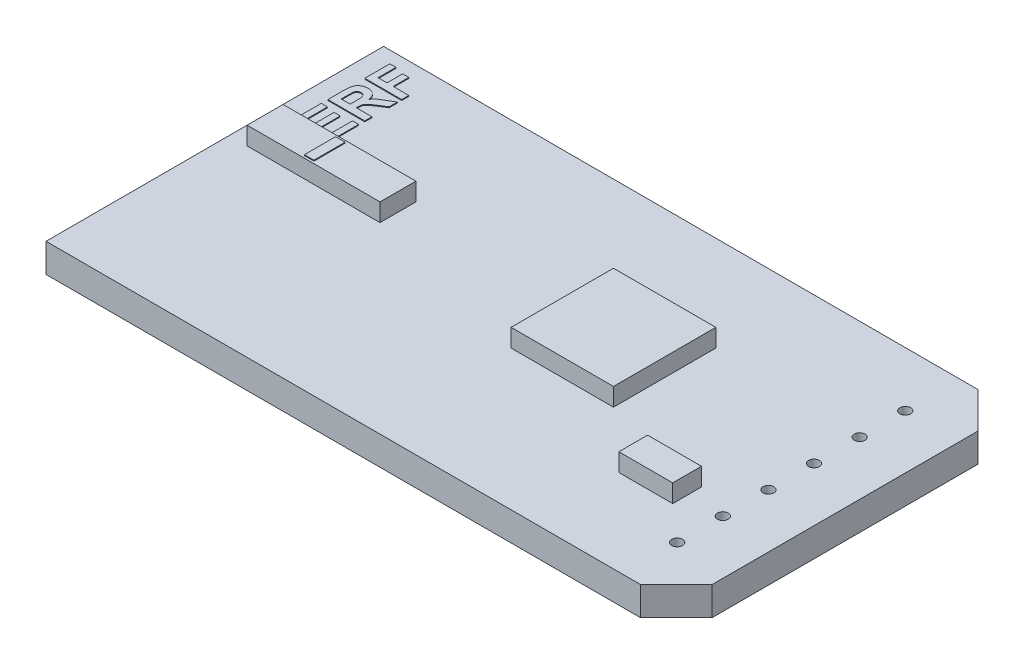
ISO-10303-21;
HEADER;
FILE_DESCRIPTION(('STEP AP214'),'2;1');
FILE_NAME('part.step','',(''),(''),'','','');
FILE_SCHEMA(('AUTOMOTIVE_DESIGN { 1 0 10303 214 1 1 1 1 }'));
ENDSEC;
DATA;
#1=APPLICATION_CONTEXT('core data for automotive mechanical design processes');
#2=APPLICATION_PROTOCOL_DEFINITION('international standard','automotive_design',2000,#1);
#3=PRODUCT_CONTEXT('',#1,'mechanical');
#4=PRODUCT('Part','Part','',(#3));
#5=PRODUCT_RELATED_PRODUCT_CATEGORY('part','',(#4));
#6=PRODUCT_DEFINITION_FORMATION('','',#4);
#7=PRODUCT_DEFINITION_CONTEXT('part definition',#1,'design');
#8=PRODUCT_DEFINITION('design','',#6,#7);
#9=PRODUCT_DEFINITION_SHAPE('','',#8);
#10=(LENGTH_UNIT() NAMED_UNIT(*) SI_UNIT(.MILLI.,.METRE.));
#11=(NAMED_UNIT(*) PLANE_ANGLE_UNIT() SI_UNIT($,.RADIAN.));
#12=(NAMED_UNIT(*) SI_UNIT($,.STERADIAN.) SOLID_ANGLE_UNIT());
#13=UNCERTAINTY_MEASURE_WITH_UNIT(LENGTH_MEASURE(1.E-05),#10,'distance_accuracy_value','');
#14=(GEOMETRIC_REPRESENTATION_CONTEXT(3) GLOBAL_UNCERTAINTY_ASSIGNED_CONTEXT((#13)) GLOBAL_UNIT_ASSIGNED_CONTEXT((#10,
#11,#12)) REPRESENTATION_CONTEXT('',''));
#15=CARTESIAN_POINT('',(0.,0.,0.));
#16=DIRECTION('',(0.,0.,1.));
#17=DIRECTION('',(1.,0.,0.));
#18=AXIS2_PLACEMENT_3D('',#15,#16,#17);
#19=CARTESIAN_POINT('',(8.4,2.6,-12.2));
#20=DIRECTION('',(0.,1.,0.));
#21=DIRECTION('',(0.,0.,1.));
#22=AXIS2_PLACEMENT_3D('',#19,#20,#21);
#23=PLANE('',#22);
#24=DIRECTION('',(0.,0.,-1.));
#25=VECTOR('',#24,1.);
#26=CARTESIAN_POINT('',(8.4,2.6,-10.2));
#27=LINE('',#26,#25);
#28=CARTESIAN_POINT('',(8.4,2.6,-10.2));
#29=VERTEX_POINT('',#28);
#30=CARTESIAN_POINT('',(8.4,2.6,-12.2));
#31=VERTEX_POINT('',#30);
#32=EDGE_CURVE('E783',#29,#31,#27,.T.);
#33=ORIENTED_EDGE('',*,*,#32,.T.);
#34=DIRECTION('',(-1.,0.,0.));
#35=VECTOR('',#34,1.);
#36=CARTESIAN_POINT('',(8.4,2.6,-12.2));
#37=LINE('',#36,#35);
#38=CARTESIAN_POINT('',(1.,2.6,-12.2));
#39=VERTEX_POINT('',#38);
#40=EDGE_CURVE('E786',#31,#39,#37,.T.);
#41=ORIENTED_EDGE('',*,*,#40,.T.);
#42=DIRECTION('',(0.,0.,1.));
#43=VECTOR('',#42,1.);
#44=CARTESIAN_POINT('',(1.,2.6,-10.2));
#45=LINE('',#44,#43);
#46=CARTESIAN_POINT('',(1.,2.6,-10.2));
#47=VERTEX_POINT('',#46);
#48=EDGE_CURVE('E789',#39,#47,#45,.T.);
#49=ORIENTED_EDGE('',*,*,#48,.T.);
#50=DIRECTION('',(1.,0.,0.));
#51=VECTOR('',#50,1.);
#52=CARTESIAN_POINT('',(8.4,2.6,-10.2));
#53=LINE('',#52,#51);
#54=EDGE_CURVE('E791',#47,#29,#53,.T.);
#55=ORIENTED_EDGE('',*,*,#54,.T.);
#56=EDGE_LOOP('',(#33,#41,#49,#55));
#57=FACE_BOUND('',#56,.T.);
#58=DIRECTION('',(1.,0.,0.));
#59=VECTOR('',#58,1.);
#60=CARTESIAN_POINT('',(4.06701739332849,2.6,-10.3254385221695));
#61=LINE('',#60,#59);
#62=CARTESIAN_POINT('',(4.06701739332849,2.6,-10.3254385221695));
#63=VERTEX_POINT('',#62);
#64=CARTESIAN_POINT('',(4.59650638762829,2.6,-10.3254385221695));
#65=VERTEX_POINT('',#64);
#66=EDGE_CURVE('E1853',#63,#65,#61,.T.);
#67=ORIENTED_EDGE('',*,*,#66,.F.);
#68=DIRECTION('',(0.,0.,1.));
#69=VECTOR('',#68,1.);
#70=CARTESIAN_POINT('',(4.06701739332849,2.6,-12.0573087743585));
#71=LINE('',#70,#69);
#72=CARTESIAN_POINT('',(4.06701739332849,2.6,-12.0573087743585));
#73=VERTEX_POINT('',#72);
#74=EDGE_CURVE('E445',#73,#63,#71,.T.);
#75=ORIENTED_EDGE('',*,*,#74,.F.);
#76=DIRECTION('',(-1.,0.,0.));
#77=VECTOR('',#76,1.);
#78=CARTESIAN_POINT('',(4.06701739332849,2.6,-12.0573087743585));
#79=LINE('',#78,#77);
#80=CARTESIAN_POINT('',(4.59650638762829,2.6,-12.0573087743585));
#81=VERTEX_POINT('',#80);
#82=EDGE_CURVE('E441',#81,#73,#79,.T.);
#83=ORIENTED_EDGE('',*,*,#82,.F.);
#84=DIRECTION('',(0.,0.,-1.));
#85=VECTOR('',#84,1.);
#86=CARTESIAN_POINT('',(4.59650638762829,2.6,-12.0573087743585));
#87=LINE('',#86,#85);
#88=EDGE_CURVE('E1850',#65,#81,#87,.T.);
#89=ORIENTED_EDGE('',*,*,#88,.F.);
#90=EDGE_LOOP('',(#67,#75,#83,#89));
#91=FACE_BOUND('',#90,.T.);
#92=ADVANCED_FACE('F33',(#57,#91),#23,.T.);
#93=CARTESIAN_POINT('',(0.,1.6,0.));
#94=DIRECTION('',(0.,1.,0.));
#95=DIRECTION('',(0.,0.,1.));
#96=AXIS2_PLACEMENT_3D('',#93,#94,#95);
#97=PLANE('',#96);
#98=DIRECTION('',(0.,0.,1.));
#99=VECTOR('',#98,1.);
#100=CARTESIAN_POINT('',(3.1177528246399,1.6,-17.0852210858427));
#101=LINE('',#100,#99);
#102=CARTESIAN_POINT('',(3.1177528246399,1.6,-17.0852210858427));
#103=VERTEX_POINT('',#102);
#104=CARTESIAN_POINT('',(3.1177528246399,1.6,-16.6900951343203));
#105=VERTEX_POINT('',#104);
#106=EDGE_CURVE('E447',#103,#105,#101,.T.);
#107=ORIENTED_EDGE('',*,*,#106,.T.);
#108=DIRECTION('',(-1.,0.,0.));
#109=VECTOR('',#108,1.);
#110=CARTESIAN_POINT('',(3.1177528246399,1.6,-16.6900951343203));
#111=LINE('',#110,#109);
#112=CARTESIAN_POINT('',(1.06309787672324,1.6,-16.6900951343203));
#113=VERTEX_POINT('',#112);
#114=EDGE_CURVE('E449',#105,#113,#111,.T.);
#115=ORIENTED_EDGE('',*,*,#114,.T.);
#116=DIRECTION('',(0.,0.,-1.));
#117=VECTOR('',#116,1.);
#118=CARTESIAN_POINT('',(1.06309787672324,1.6,-16.6900951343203));
#119=LINE('',#118,#117);
#120=CARTESIAN_POINT('',(1.06309787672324,1.6,-18.0862068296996));
#121=VERTEX_POINT('',#120);
#122=EDGE_CURVE('E486',#113,#121,#119,.T.);
#123=ORIENTED_EDGE('',*,*,#122,.T.);
#124=DIRECTION('',(1.,0.,0.));
#125=VECTOR('',#124,1.);
#126=CARTESIAN_POINT('',(1.06309787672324,1.6,-18.0862068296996));
#127=LINE('',#126,#125);
#128=CARTESIAN_POINT('',(1.40554036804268,1.6,-18.0862068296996));
#129=VERTEX_POINT('',#128);
#130=EDGE_CURVE('E488',#121,#129,#127,.T.);
#131=ORIENTED_EDGE('',*,*,#130,.T.);
#132=DIRECTION('',(0.,0.,1.));
#133=VECTOR('',#132,1.);
#134=CARTESIAN_POINT('',(1.40554036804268,1.6,-18.0862068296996));
#135=LINE('',#134,#133);
#136=CARTESIAN_POINT('',(1.40554036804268,1.6,-17.0852210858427));
#137=VERTEX_POINT('',#136);
#138=EDGE_CURVE('E490',#129,#137,#135,.T.);
#139=ORIENTED_EDGE('',*,*,#138,.T.);
#140=DIRECTION('',(1.,0.,0.));
#141=VECTOR('',#140,1.);
#142=CARTESIAN_POINT('',(1.40554036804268,1.6,-17.0852210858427));
#143=LINE('',#142,#141);
#144=CARTESIAN_POINT('',(1.9060332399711,1.6,-17.0852210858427));
#145=VERTEX_POINT('',#144);
#146=EDGE_CURVE('E492',#137,#145,#143,.T.);
#147=ORIENTED_EDGE('',*,*,#146,.T.);
#148=DIRECTION('',(0.,0.,-1.));
#149=VECTOR('',#148,1.);
#150=CARTESIAN_POINT('',(1.9060332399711,1.6,-17.0852210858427));
#151=LINE('',#150,#149);
#152=CARTESIAN_POINT('',(1.9060332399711,1.6,-17.9544981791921));
#153=VERTEX_POINT('',#152);
#154=EDGE_CURVE('E494',#145,#153,#151,.T.);
#155=ORIENTED_EDGE('',*,*,#154,.T.);
#156=DIRECTION('',(1.,0.,0.));
#157=VECTOR('',#156,1.);
#158=CARTESIAN_POINT('',(1.9060332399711,1.6,-17.9544981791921));
#159=LINE('',#158,#157);
#160=CARTESIAN_POINT('',(2.24847573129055,1.6,-17.9544981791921));
#161=VERTEX_POINT('',#160);
#162=EDGE_CURVE('E496',#153,#161,#159,.T.);
#163=ORIENTED_EDGE('',*,*,#162,.T.);
#164=DIRECTION('',(0.,0.,1.));
#165=VECTOR('',#164,1.);
#166=CARTESIAN_POINT('',(2.24847573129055,1.6,-17.9544981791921));
#167=LINE('',#166,#165);
#168=CARTESIAN_POINT('',(2.24847573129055,1.6,-17.0852210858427));
#169=VERTEX_POINT('',#168);
#170=EDGE_CURVE('E498',#161,#169,#167,.T.);
#171=ORIENTED_EDGE('',*,*,#170,.T.);
#172=DIRECTION('',(1.,0.,0.));
#173=VECTOR('',#172,1.);
#174=CARTESIAN_POINT('',(2.24847573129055,1.6,-17.0852210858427));
#175=LINE('',#174,#173);
#176=EDGE_CURVE('E56',#169,#103,#175,.T.);
#177=ORIENTED_EDGE('',*,*,#176,.T.);
#178=EDGE_LOOP('',(#107,#115,#123,#131,#139,#147,#155,#163,#171,#177));
#179=FACE_BOUND('',#178,.T.);
#180=DIRECTION('',(0.,0.,1.));
#181=VECTOR('',#180,1.);
#182=CARTESIAN_POINT('',(3.1177528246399,1.6,-15.0305661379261));
#183=LINE('',#182,#181);
#184=CARTESIAN_POINT('',(3.1177528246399,1.6,-15.0305661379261));
#185=VERTEX_POINT('',#184);
#186=CARTESIAN_POINT('',(3.1177528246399,1.6,-14.6354401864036));
#187=VERTEX_POINT('',#186);
#188=EDGE_CURVE('E605',#185,#187,#183,.T.);
#189=ORIENTED_EDGE('',*,*,#188,.T.);
#190=DIRECTION('',(-1.,0.,0.));
#191=VECTOR('',#190,1.);
#192=CARTESIAN_POINT('',(3.1177528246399,1.6,-14.6354401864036));
#193=LINE('',#192,#191);
#194=CARTESIAN_POINT('',(1.06309787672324,1.6,-14.6354401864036));
#195=VERTEX_POINT('',#194);
#196=EDGE_CURVE('E607',#187,#195,#193,.T.);
#197=ORIENTED_EDGE('',*,*,#196,.T.);
#198=DIRECTION('',(0.,0.,-1.));
#199=VECTOR('',#198,1.);
#200=CARTESIAN_POINT('',(1.06309787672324,1.6,-14.6354401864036));
#201=LINE('',#200,#199);
#202=CARTESIAN_POINT('',(1.06309787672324,1.6,-15.4977202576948));
#203=VERTEX_POINT('',#202);
#204=EDGE_CURVE('E610',#195,#203,#201,.T.);
#205=ORIENTED_EDGE('',*,*,#204,.T.);
#206=CARTESIAN_POINT('',(1.06309787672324,1.6,-15.4977202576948));
#207=CARTESIAN_POINT('',(1.06325938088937,1.6,-15.5239258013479));
#208=CARTESIAN_POINT('',(1.06357062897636,1.6,-15.5744286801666));
#209=CARTESIAN_POINT('',(1.06584031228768,1.6,-15.6474656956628));
#210=CARTESIAN_POINT('',(1.07059543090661,1.6,-15.7148222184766));
#211=CARTESIAN_POINT('',(1.07598064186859,1.6,-15.7767970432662));
#212=CARTESIAN_POINT('',(1.08381577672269,1.6,-15.8330924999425));
#213=CARTESIAN_POINT('',(1.0932021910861,1.6,-15.8839311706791));
#214=CARTESIAN_POINT('',(1.10407975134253,1.6,-15.9292274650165));
#215=CARTESIAN_POINT('',(1.11710739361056,1.6,-15.9696422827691));
#216=CARTESIAN_POINT('',(1.13201798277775,1.6,-16.0064923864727));
#217=CARTESIAN_POINT('',(1.14976577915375,1.6,-16.0408200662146));
#218=CARTESIAN_POINT('',(1.17055950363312,1.6,-16.0730027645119));
#219=CARTESIAN_POINT('',(1.19368245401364,1.6,-16.103534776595));
#220=CARTESIAN_POINT('',(1.21917015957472,1.6,-16.1325453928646));
#221=CARTESIAN_POINT('',(1.24769715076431,1.6,-16.1592392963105));
#222=CARTESIAN_POINT('',(1.27883865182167,1.6,-16.1840815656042));
#223=CARTESIAN_POINT('',(1.31233556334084,1.6,-16.2070521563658));
#224=CARTESIAN_POINT('',(1.34803997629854,1.6,-16.2272878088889));
#225=CARTESIAN_POINT('',(1.3848052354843,1.6,-16.2457778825));
#226=CARTESIAN_POINT('',(1.4230225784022,1.6,-16.2608294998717));
#227=CARTESIAN_POINT('',(1.46251197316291,1.6,-16.2732619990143));
#228=CARTESIAN_POINT('',(1.50318768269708,1.6,-16.2831932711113));
#229=CARTESIAN_POINT('',(1.54515311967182,1.6,-16.2900864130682));
#230=CARTESIAN_POINT('',(1.58833232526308,1.6,-16.2943897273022));
#231=CARTESIAN_POINT('',(1.61749862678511,1.6,-16.2947738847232));
#232=CARTESIAN_POINT('',(1.63232620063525,1.6,-16.2949691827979));
#233=B_SPLINE_CURVE_WITH_KNOTS('',3,(#206,#207,#208,#209,#210,#211,#212,#213,#214,#215,#216,
#217,#218,#219,#220,#221,#222,#223,#224,#225,#226,#227,#228,#229,#230,#231,#232),.UNSPECIFIED.,
.F.,.F.,(4,1,1,1,1,1,1,1,1,1,1,1,1,1,1,1,1,1,1,1,1,1,1,1,4),(0.,0.0698261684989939,
0.134567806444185,0.194654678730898,0.249727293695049,0.300288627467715,0.346032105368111,
0.387437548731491,0.42431585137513,0.459073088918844,0.49324482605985,0.527114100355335,
0.561038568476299,0.595222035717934,0.629875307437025,0.664986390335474,0.701285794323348,
0.737967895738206,0.774261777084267,0.810850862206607,0.847269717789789,0.884508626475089,
0.922310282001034,0.960504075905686,1.),.UNSPECIFIED.);
#234=CARTESIAN_POINT('',(1.63232620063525,1.6,-16.2949691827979));
#235=VERTEX_POINT('',#234);
#236=EDGE_CURVE('E612',#203,#235,#233,.T.);
#237=ORIENTED_EDGE('',*,*,#236,.T.);
#238=CARTESIAN_POINT('',(1.63232620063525,1.6,-16.2949691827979));
#239=CARTESIAN_POINT('',(1.65100479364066,1.6,-16.2946069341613));
#240=CARTESIAN_POINT('',(1.68750791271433,1.6,-16.2938990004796));
#241=CARTESIAN_POINT('',(1.74101012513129,1.6,-16.2873842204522));
#242=CARTESIAN_POINT('',(1.79212766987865,1.6,-16.27770810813));
#243=CARTESIAN_POINT('',(1.84093136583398,1.6,-16.2639148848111));
#244=CARTESIAN_POINT('',(1.88684721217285,1.6,-16.244949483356));
#245=CARTESIAN_POINT('',(1.93051842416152,1.6,-16.2229329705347));
#246=CARTESIAN_POINT('',(1.97179686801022,1.6,-16.1966745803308));
#247=CARTESIAN_POINT('',(2.01027333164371,1.6,-16.1663527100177));
#248=CARTESIAN_POINT('',(2.04598187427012,1.6,-16.1319945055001));
#249=CARTESIAN_POINT('',(2.07818764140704,1.6,-16.0934493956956));
#250=CARTESIAN_POINT('',(2.10701650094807,1.6,-16.0509925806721));
#251=CARTESIAN_POINT('',(2.13230220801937,1.6,-16.004367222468));
#252=CARTESIAN_POINT('',(2.15391874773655,1.6,-15.9538979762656));
#253=CARTESIAN_POINT('',(2.17210624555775,1.6,-15.8993659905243));
#254=CARTESIAN_POINT('',(2.18690884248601,1.6,-15.8410181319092));
#255=CARTESIAN_POINT('',(2.19387390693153,1.6,-15.8004313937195));
#256=CARTESIAN_POINT('',(2.1974386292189,1.6,-15.7796590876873));
#257=B_SPLINE_CURVE_WITH_KNOTS('',3,(#238,#239,#240,#241,#242,#243,#244,#245,#246,#247,#248,
#249,#250,#251,#252,#253,#254,#255,#256),.UNSPECIFIED.,.F.,.F.,(4,1,1,1,1,1,1,1,1,1,1,1,1,1,1,1,
4),(0.,0.0661945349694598,0.129362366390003,0.190794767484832,0.250524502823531,
0.308782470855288,0.366645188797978,0.423721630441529,0.481910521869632,0.540044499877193,
0.599083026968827,0.659656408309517,0.721688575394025,0.786832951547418,0.854048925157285,
0.925302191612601,1.),.UNSPECIFIED.);
#258=CARTESIAN_POINT('',(2.1974386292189,1.6,-15.7796590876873));
#259=VERTEX_POINT('',#258);
#260=EDGE_CURVE('E616',#235,#259,#257,.T.);
#261=ORIENTED_EDGE('',*,*,#260,.T.);
#262=CARTESIAN_POINT('',(2.1974386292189,1.6,-15.7796590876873));
#263=CARTESIAN_POINT('',(2.21074705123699,1.6,-15.7997445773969));
#264=CARTESIAN_POINT('',(2.23679344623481,1.6,-15.8390546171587));
#265=CARTESIAN_POINT('',(2.27963731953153,1.6,-15.8935040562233));
#266=CARTESIAN_POINT('',(2.3247424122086,1.6,-15.9420842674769));
#267=CARTESIAN_POINT('',(2.36429207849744,1.6,-15.9796212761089));
#268=CARTESIAN_POINT('',(2.39986184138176,1.6,-16.0074131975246));
#269=CARTESIAN_POINT('',(2.43030867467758,1.6,-16.0307278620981));
#270=CARTESIAN_POINT('',(2.46580989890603,1.6,-16.0553339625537));
#271=CARTESIAN_POINT('',(2.50618225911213,1.6,-16.0813487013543));
#272=CARTESIAN_POINT('',(2.55062819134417,1.6,-16.1100653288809));
#273=CARTESIAN_POINT('',(2.6000391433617,1.6,-16.139876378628));
#274=CARTESIAN_POINT('',(2.65393484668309,1.6,-16.1716170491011));
#275=CARTESIAN_POINT('',(2.69158799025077,1.6,-16.1929511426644));
#276=CARTESIAN_POINT('',(2.71110236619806,1.6,-16.2040078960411));
#277=B_SPLINE_CURVE_WITH_KNOTS('',3,(#262,#263,#264,#265,#266,#267,#268,#269,#270,#271,#272,
#273,#274,#275,#276),.UNSPECIFIED.,.F.,.F.,(4,1,1,1,1,1,1,1,1,1,1,1,4),(0.,0.107115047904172,
0.209638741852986,0.307642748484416,0.40175055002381,0.451677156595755,0.508293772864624,
0.572268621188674,0.643677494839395,0.721866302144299,0.807559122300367,0.90026427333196,1.),.UNSPECIFIED.);
#278=CARTESIAN_POINT('',(2.71110236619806,1.6,-16.2040078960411));
#279=VERTEX_POINT('',#278);
#280=EDGE_CURVE('E623',#259,#279,#277,.T.);
#281=ORIENTED_EDGE('',*,*,#280,.T.);
#282=DIRECTION('',(0.852812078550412,0.,-0.522217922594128));
#283=VECTOR('',#282,1.);
#284=CARTESIAN_POINT('',(2.71110236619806,1.6,-16.2040078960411));
#285=LINE('',#284,#283);
#286=CARTESIAN_POINT('',(3.11775282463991,1.6,-16.4530195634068));
#287=VERTEX_POINT('',#286);
#288=EDGE_CURVE('E630',#279,#287,#285,.T.);
#289=ORIENTED_EDGE('',*,*,#288,.T.);
#290=DIRECTION('',(0.,0.,1.));
#291=VECTOR('',#290,1.);
#292=CARTESIAN_POINT('',(3.1177528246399,1.6,-16.4530195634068));
#293=LINE('',#292,#291);
#294=CARTESIAN_POINT('',(3.1177528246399,1.6,-15.991216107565));
#295=VERTEX_POINT('',#294);
#296=EDGE_CURVE('E635',#287,#295,#293,.T.);
#297=ORIENTED_EDGE('',*,*,#296,.T.);
#298=DIRECTION('',(-0.847367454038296,0.,0.531006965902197));
#299=VECTOR('',#298,1.);
#300=CARTESIAN_POINT('',(3.1177528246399,1.6,-15.991216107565));
#301=LINE('',#300,#299);
#302=CARTESIAN_POINT('',(2.65142188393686,1.6,-15.6989875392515));
#303=VERTEX_POINT('',#302);
#304=EDGE_CURVE('E637',#295,#303,#301,.T.);
#305=ORIENTED_EDGE('',*,*,#304,.T.);
#306=CARTESIAN_POINT('',(2.65142188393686,1.6,-15.6989875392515));
#307=CARTESIAN_POINT('',(2.6327429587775,1.6,-15.6855701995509));
#308=CARTESIAN_POINT('',(2.59708105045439,1.6,-15.6599537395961));
#309=CARTESIAN_POINT('',(2.54644658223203,1.6,-15.6229194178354));
#310=CARTESIAN_POINT('',(2.50131634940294,1.6,-15.5892912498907));
#311=CARTESIAN_POINT('',(2.46147592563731,1.6,-15.5590391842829));
#312=CARTESIAN_POINT('',(2.42700227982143,1.6,-15.5322101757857));
#313=CARTESIAN_POINT('',(2.39830503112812,1.6,-15.5081654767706));
#314=CARTESIAN_POINT('',(2.3744362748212,1.6,-15.4881580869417));
#315=CARTESIAN_POINT('',(2.35082252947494,1.6,-15.4654701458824));
#316=CARTESIAN_POINT('',(2.32640566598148,1.6,-15.4392773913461));
#317=CARTESIAN_POINT('',(2.3034860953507,1.6,-15.4062173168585));
#318=CARTESIAN_POINT('',(2.28405074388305,1.6,-15.3730964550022));
#319=CARTESIAN_POINT('',(2.2698618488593,1.6,-15.3370211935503));
#320=CARTESIAN_POINT('',(2.25981772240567,1.6,-15.2955183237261));
#321=CARTESIAN_POINT('',(2.2534690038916,1.6,-15.2455782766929));
#322=CARTESIAN_POINT('',(2.24876555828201,1.6,-15.1856863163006));
#323=CARTESIAN_POINT('',(2.24857723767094,1.6,-15.1423932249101));
#324=CARTESIAN_POINT('',(2.24847573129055,1.6,-15.1190578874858));
#325=B_SPLINE_CURVE_WITH_KNOTS('',3,(#306,#307,#308,#309,#310,#311,#312,#313,#314,#315,#316,
#317,#318,#319,#320,#321,#322,#323,#324),.UNSPECIFIED.,.F.,.F.,(4,1,1,1,1,1,1,1,1,1,1,1,1,1,1,1,
4),(0.,0.0915957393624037,0.174875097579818,0.249843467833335,0.315742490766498,
0.374114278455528,0.4237869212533,0.464858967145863,0.498096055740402,0.554185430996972,
0.607097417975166,0.657996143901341,0.706801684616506,0.760871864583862,0.827637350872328,
0.907095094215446,1.),.UNSPECIFIED.);
#326=CARTESIAN_POINT('',(2.24847573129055,1.6,-15.1190578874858));
#327=VERTEX_POINT('',#326);
#328=EDGE_CURVE('E639',#303,#327,#325,.T.);
#329=ORIENTED_EDGE('',*,*,#328,.T.);
#330=DIRECTION('',(0.,0.,1.));
#331=VECTOR('',#330,1.);
#332=CARTESIAN_POINT('',(2.24847573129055,1.6,-15.1190578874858));
#333=LINE('',#332,#331);
#334=CARTESIAN_POINT('',(2.24847573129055,1.6,-15.0305661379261));
#335=VERTEX_POINT('',#334);
#336=EDGE_CURVE('E643',#327,#335,#333,.T.);
#337=ORIENTED_EDGE('',*,*,#336,.T.);
#338=DIRECTION('',(1.,0.,0.));
#339=VECTOR('',#338,1.);
#340=CARTESIAN_POINT('',(2.24847573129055,1.6,-15.0305661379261));
#341=LINE('',#340,#339);
#342=EDGE_CURVE('E648',#335,#185,#341,.T.);
#343=ORIENTED_EDGE('',*,*,#342,.T.);
#344=EDGE_LOOP('',(#189,#197,#205,#237,#261,#281,#289,#297,#305,#329,#337,#343));
#345=FACE_BOUND('',#344,.T.);
#346=DIRECTION('',(-1.,0.,0.));
#347=VECTOR('',#346,1.);
#348=CARTESIAN_POINT('',(8.4,1.6,-12.2));
#349=LINE('',#348,#347);
#350=CARTESIAN_POINT('',(8.4,1.6,-12.2));
#351=VERTEX_POINT('',#350);
#352=CARTESIAN_POINT('',(1.,1.6,-12.2));
#353=VERTEX_POINT('',#352);
#354=EDGE_CURVE('E796',#351,#353,#349,.T.);
#355=ORIENTED_EDGE('',*,*,#354,.F.);
#356=DIRECTION('',(0.,0.,-1.));
#357=VECTOR('',#356,1.);
#358=CARTESIAN_POINT('',(8.4,1.6,-10.2));
#359=LINE('',#358,#357);
#360=CARTESIAN_POINT('',(8.4,1.6,-10.2));
#361=VERTEX_POINT('',#360);
#362=EDGE_CURVE('E750',#361,#351,#359,.T.);
#363=ORIENTED_EDGE('',*,*,#362,.F.);
#364=DIRECTION('',(1.,0.,0.));
#365=VECTOR('',#364,1.);
#366=CARTESIAN_POINT('',(8.4,1.6,-10.2));
#367=LINE('',#366,#365);
#368=CARTESIAN_POINT('',(1.,1.6,-10.2));
#369=VERTEX_POINT('',#368);
#370=EDGE_CURVE('E787',#369,#361,#367,.T.);
#371=ORIENTED_EDGE('',*,*,#370,.F.);
#372=DIRECTION('',(0.,0.,1.));
#373=VECTOR('',#372,1.);
#374=CARTESIAN_POINT('',(1.,1.6,-10.2));
#375=LINE('',#374,#373);
#376=EDGE_CURVE('E798',#353,#369,#375,.T.);
#377=ORIENTED_EDGE('',*,*,#376,.F.);
#378=EDGE_LOOP('',(#355,#363,#371,#377));
#379=FACE_BOUND('',#378,.T.);
#380=DIRECTION('',(1.,0.,0.));
#381=VECTOR('',#380,1.);
#382=CARTESIAN_POINT('',(18.1,1.6,-7.8));
#383=LINE('',#382,#381);
#384=CARTESIAN_POINT('',(18.1,1.6,-7.8));
#385=VERTEX_POINT('',#384);
#386=CARTESIAN_POINT('',(23.8,1.6,-7.8));
#387=VERTEX_POINT('',#386);
#388=EDGE_CURVE('E854',#385,#387,#383,.T.);
#389=ORIENTED_EDGE('',*,*,#388,.F.);
#390=DIRECTION('',(0.,0.,1.));
#391=VECTOR('',#390,1.);
#392=CARTESIAN_POINT('',(18.1,1.6,-7.8));
#393=LINE('',#392,#391);
#394=CARTESIAN_POINT('',(18.1,1.6,-13.5));
#395=VERTEX_POINT('',#394);
#396=EDGE_CURVE('E840',#395,#385,#393,.T.);
#397=ORIENTED_EDGE('',*,*,#396,.F.);
#398=DIRECTION('',(-1.,0.,0.));
#399=VECTOR('',#398,1.);
#400=CARTESIAN_POINT('',(18.1,1.6,-13.5));
#401=LINE('',#400,#399);
#402=CARTESIAN_POINT('',(23.8,1.6,-13.5));
#403=VERTEX_POINT('',#402);
#404=EDGE_CURVE('E845',#403,#395,#401,.T.);
#405=ORIENTED_EDGE('',*,*,#404,.F.);
#406=DIRECTION('',(0.,0.,-1.));
#407=VECTOR('',#406,1.);
#408=CARTESIAN_POINT('',(23.8,1.6,-7.8));
#409=LINE('',#408,#407);
#410=EDGE_CURVE('E856',#387,#403,#409,.T.);
#411=ORIENTED_EDGE('',*,*,#410,.F.);
#412=EDGE_LOOP('',(#389,#397,#405,#411));
#413=FACE_BOUND('',#412,.T.);
#414=CARTESIAN_POINT('',(32.1,1.6,-5.59));
#415=DIRECTION('',(0.,1.,0.));
#416=DIRECTION('',(0.,0.,-1.));
#417=AXIS2_PLACEMENT_3D('',#414,#415,#416);
#418=CIRCLE('',#417,0.300000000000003);
#419=CARTESIAN_POINT('',(32.1,1.6,-5.89));
#420=VERTEX_POINT('',#419);
#421=EDGE_CURVE('E876',#420,#420,#418,.T.);
#422=ORIENTED_EDGE('',*,*,#421,.F.);
#423=EDGE_LOOP('',(#422));
#424=FACE_BOUND('',#423,.T.);
#425=CARTESIAN_POINT('',(32.1,1.6,-13.21));
#426=DIRECTION('',(0.,1.,0.));
#427=DIRECTION('',(0.,0.,1.));
#428=AXIS2_PLACEMENT_3D('',#425,#426,#427);
#429=CIRCLE('',#428,0.300000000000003);
#430=CARTESIAN_POINT('',(32.1,1.6,-12.91));
#431=VERTEX_POINT('',#430);
#432=EDGE_CURVE('E888',#431,#431,#429,.T.);
#433=ORIENTED_EDGE('',*,*,#432,.F.);
#434=EDGE_LOOP('',(#433));
#435=FACE_BOUND('',#434,.T.);
#436=CARTESIAN_POINT('',(32.1,1.6,-10.67));
#437=DIRECTION('',(0.,1.,0.));
#438=DIRECTION('',(0.,0.,1.));
#439=AXIS2_PLACEMENT_3D('',#436,#437,#438);
#440=CIRCLE('',#439,0.300000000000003);
#441=CARTESIAN_POINT('',(32.1,1.6,-10.37));
#442=VERTEX_POINT('',#441);
#443=EDGE_CURVE('E900',#442,#442,#440,.T.);
#444=ORIENTED_EDGE('',*,*,#443,.F.);
#445=EDGE_LOOP('',(#444));
#446=FACE_BOUND('',#445,.T.);
#447=DIRECTION('',(0.,0.,1.));
#448=VECTOR('',#447,1.);
#449=CARTESIAN_POINT('',(0.,1.6,-18.8));
#450=LINE('',#449,#448);
#451=CARTESIAN_POINT('',(0.,1.6,-18.8));
#452=VERTEX_POINT('',#451);
#453=CARTESIAN_POINT('',(0.,1.6,0.));
#454=VERTEX_POINT('',#453);
#455=EDGE_CURVE('E906',#452,#454,#450,.T.);
#456=ORIENTED_EDGE('',*,*,#455,.T.);
#457=DIRECTION('',(1.,0.,0.));
#458=VECTOR('',#457,1.);
#459=CARTESIAN_POINT('',(0.,1.6,0.));
#460=LINE('',#459,#458);
#461=CARTESIAN_POINT('',(33.1,1.6,0.));
#462=VERTEX_POINT('',#461);
#463=EDGE_CURVE('E909',#454,#462,#460,.T.);
#464=ORIENTED_EDGE('',*,*,#463,.T.);
#465=DIRECTION('',(0.707106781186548,0.,-0.707106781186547));
#466=VECTOR('',#465,1.);
#467=CARTESIAN_POINT('',(33.1,1.6,0.));
#468=LINE('',#467,#466);
#469=CARTESIAN_POINT('',(35.1,1.6,-1.99999999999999));
#470=VERTEX_POINT('',#469);
#471=EDGE_CURVE('E912',#462,#470,#468,.T.);
#472=ORIENTED_EDGE('',*,*,#471,.T.);
#473=DIRECTION('',(0.,0.,-1.));
#474=VECTOR('',#473,1.);
#475=CARTESIAN_POINT('',(35.1,1.6,-16.8));
#476=LINE('',#475,#474);
#477=CARTESIAN_POINT('',(35.1,1.6,-16.8));
#478=VERTEX_POINT('',#477);
#479=EDGE_CURVE('E914',#470,#478,#476,.T.);
#480=ORIENTED_EDGE('',*,*,#479,.T.);
#481=DIRECTION('',(-0.707106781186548,0.,-0.707106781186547));
#482=VECTOR('',#481,1.);
#483=CARTESIAN_POINT('',(33.1,1.6,-18.8));
#484=LINE('',#483,#482);
#485=CARTESIAN_POINT('',(33.1,1.6,-18.8));
#486=VERTEX_POINT('',#485);
#487=EDGE_CURVE('E916',#478,#486,#484,.T.);
#488=ORIENTED_EDGE('',*,*,#487,.T.);
#489=DIRECTION('',(-1.,0.,0.));
#490=VECTOR('',#489,1.);
#491=CARTESIAN_POINT('',(0.,1.6,-18.8));
#492=LINE('',#491,#490);
#493=EDGE_CURVE('E918',#486,#452,#492,.T.);
#494=ORIENTED_EDGE('',*,*,#493,.T.);
#495=EDGE_LOOP('',(#456,#464,#472,#480,#488,#494));
#496=FACE_BOUND('',#495,.T.);
#497=CARTESIAN_POINT('',(32.1,1.6,-3.05));
#498=DIRECTION('',(0.,1.,0.));
#499=DIRECTION('',(0.,0.,-1.));
#500=AXIS2_PLACEMENT_3D('',#497,#498,#499);
#501=CIRCLE('',#500,0.299999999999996);
#502=CARTESIAN_POINT('',(32.1,1.6,-3.34999999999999));
#503=VERTEX_POINT('',#502);
#504=EDGE_CURVE('E894',#503,#503,#501,.T.);
#505=ORIENTED_EDGE('',*,*,#504,.F.);
#506=EDGE_LOOP('',(#505));
#507=FACE_BOUND('',#506,.T.);
#508=CARTESIAN_POINT('',(32.1,1.6,-15.75));
#509=DIRECTION('',(0.,1.,0.));
#510=DIRECTION('',(0.,0.,1.));
#511=AXIS2_PLACEMENT_3D('',#508,#509,#510);
#512=CIRCLE('',#511,0.300000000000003);
#513=CARTESIAN_POINT('',(32.1,1.6,-15.45));
#514=VERTEX_POINT('',#513);
#515=EDGE_CURVE('E882',#514,#514,#512,.T.);
#516=ORIENTED_EDGE('',*,*,#515,.F.);
#517=EDGE_LOOP('',(#516));
#518=FACE_BOUND('',#517,.T.);
#519=CARTESIAN_POINT('',(32.1,1.6,-8.13));
#520=DIRECTION('',(0.,1.,0.));
#521=DIRECTION('',(0.,0.,-1.));
#522=AXIS2_PLACEMENT_3D('',#519,#520,#521);
#523=CIRCLE('',#522,0.300000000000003);
#524=CARTESIAN_POINT('',(32.1,1.6,-8.43));
#525=VERTEX_POINT('',#524);
#526=EDGE_CURVE('E870',#525,#525,#523,.T.);
#527=ORIENTED_EDGE('',*,*,#526,.F.);
#528=EDGE_LOOP('',(#527));
#529=FACE_BOUND('',#528,.T.);
#530=DIRECTION('',(1.,0.,0.));
#531=VECTOR('',#530,1.);
#532=CARTESIAN_POINT('',(27.1,1.6,-4.8));
#533=LINE('',#532,#531);
#534=CARTESIAN_POINT('',(27.1,1.6,-4.8));
#535=VERTEX_POINT('',#534);
#536=CARTESIAN_POINT('',(30.1,1.6,-4.8));
#537=VERTEX_POINT('',#536);
#538=EDGE_CURVE('E825',#535,#537,#533,.T.);
#539=ORIENTED_EDGE('',*,*,#538,.F.);
#540=DIRECTION('',(0.,0.,1.));
#541=VECTOR('',#540,1.);
#542=CARTESIAN_POINT('',(27.1,1.6,-4.8));
#543=LINE('',#542,#541);
#544=CARTESIAN_POINT('',(27.1,1.6,-6.4));
#545=VERTEX_POINT('',#544);
#546=EDGE_CURVE('E811',#545,#535,#543,.T.);
#547=ORIENTED_EDGE('',*,*,#546,.F.);
#548=DIRECTION('',(-1.,0.,0.));
#549=VECTOR('',#548,1.);
#550=CARTESIAN_POINT('',(27.1,1.6,-6.4));
#551=LINE('',#550,#549);
#552=CARTESIAN_POINT('',(30.1,1.6,-6.4));
#553=VERTEX_POINT('',#552);
#554=EDGE_CURVE('E816',#553,#545,#551,.T.);
#555=ORIENTED_EDGE('',*,*,#554,.F.);
#556=DIRECTION('',(0.,0.,-1.));
#557=VECTOR('',#556,1.);
#558=CARTESIAN_POINT('',(30.1,1.6,-4.8));
#559=LINE('',#558,#557);
#560=EDGE_CURVE('E827',#537,#553,#559,.T.);
#561=ORIENTED_EDGE('',*,*,#560,.F.);
#562=EDGE_LOOP('',(#539,#547,#555,#561));
#563=FACE_BOUND('',#562,.T.);
#564=DIRECTION('',(0.,0.,1.));
#565=VECTOR('',#564,1.);
#566=CARTESIAN_POINT('',(3.1177528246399,1.6,-14.2929976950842));
#567=LINE('',#566,#565);
#568=CARTESIAN_POINT('',(3.1177528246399,1.6,-14.2929976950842));
#569=VERTEX_POINT('',#568);
#570=CARTESIAN_POINT('',(3.1177528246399,1.6,-12.7388356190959));
#571=VERTEX_POINT('',#570);
#572=EDGE_CURVE('E654',#569,#571,#567,.T.);
#573=ORIENTED_EDGE('',*,*,#572,.T.);
#574=DIRECTION('',(-1.,0.,0.));
#575=VECTOR('',#574,1.);
#576=CARTESIAN_POINT('',(3.1177528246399,1.6,-12.7388356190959));
#577=LINE('',#576,#575);
#578=CARTESIAN_POINT('',(1.06309787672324,1.6,-12.7388356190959));
#579=VERTEX_POINT('',#578);
#580=EDGE_CURVE('E726',#571,#579,#577,.T.);
#581=ORIENTED_EDGE('',*,*,#580,.T.);
#582=DIRECTION('',(0.,0.,-1.));
#583=VECTOR('',#582,1.);
#584=CARTESIAN_POINT('',(1.06309787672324,1.6,-12.7388356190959));
#585=LINE('',#584,#583);
#586=CARTESIAN_POINT('',(1.06309787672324,1.6,-14.2666559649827));
#587=VERTEX_POINT('',#586);
#588=EDGE_CURVE('E728',#579,#587,#585,.T.);
#589=ORIENTED_EDGE('',*,*,#588,.T.);
#590=DIRECTION('',(1.,0.,0.));
#591=VECTOR('',#590,1.);
#592=CARTESIAN_POINT('',(1.06309787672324,1.6,-14.2666559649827));
#593=LINE('',#592,#591);
#594=CARTESIAN_POINT('',(1.40554036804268,1.6,-14.2666559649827));
#595=VERTEX_POINT('',#594);
#596=EDGE_CURVE('E730',#587,#595,#593,.T.);
#597=ORIENTED_EDGE('',*,*,#596,.T.);
#598=DIRECTION('',(0.,0.,1.));
#599=VECTOR('',#598,1.);
#600=CARTESIAN_POINT('',(1.40554036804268,1.6,-14.2666559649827));
#601=LINE('',#600,#599);
#602=CARTESIAN_POINT('',(1.40554036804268,1.6,-13.1339615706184));
#603=VERTEX_POINT('',#602);
#604=EDGE_CURVE('E732',#595,#603,#601,.T.);
#605=ORIENTED_EDGE('',*,*,#604,.T.);
#606=DIRECTION('',(1.,0.,0.));
#607=VECTOR('',#606,1.);
#608=CARTESIAN_POINT('',(1.40554036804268,1.6,-13.1339615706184));
#609=LINE('',#608,#607);
#610=CARTESIAN_POINT('',(1.85334977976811,1.6,-13.1339615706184));
#611=VERTEX_POINT('',#610);
#612=EDGE_CURVE('E734',#603,#611,#609,.T.);
#613=ORIENTED_EDGE('',*,*,#612,.T.);
#614=DIRECTION('',(0.,0.,-1.));
#615=VECTOR('',#614,1.);
#616=CARTESIAN_POINT('',(1.85334977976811,1.6,-13.1339615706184));
#617=LINE('',#616,#615);
#618=CARTESIAN_POINT('',(1.85334977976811,1.6,-14.1876307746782));
#619=VERTEX_POINT('',#618);
#620=EDGE_CURVE('E736',#611,#619,#617,.T.);
#621=ORIENTED_EDGE('',*,*,#620,.T.);
#622=DIRECTION('',(1.,0.,0.));
#623=VECTOR('',#622,1.);
#624=CARTESIAN_POINT('',(1.85334977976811,1.6,-14.1876307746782));
#625=LINE('',#624,#623);
#626=CARTESIAN_POINT('',(2.19579227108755,1.6,-14.1876307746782));
#627=VERTEX_POINT('',#626);
#628=EDGE_CURVE('E738',#619,#627,#625,.T.);
#629=ORIENTED_EDGE('',*,*,#628,.T.);
#630=DIRECTION('',(0.,0.,1.));
#631=VECTOR('',#630,1.);
#632=CARTESIAN_POINT('',(2.19579227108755,1.6,-14.1876307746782));
#633=LINE('',#632,#631);
#634=CARTESIAN_POINT('',(2.19579227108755,1.6,-13.1339615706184));
#635=VERTEX_POINT('',#634);
#636=EDGE_CURVE('E740',#627,#635,#633,.T.);
#637=ORIENTED_EDGE('',*,*,#636,.T.);
#638=DIRECTION('',(1.,0.,0.));
#639=VECTOR('',#638,1.);
#640=CARTESIAN_POINT('',(2.19579227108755,1.6,-13.1339615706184));
#641=LINE('',#640,#639);
#642=CARTESIAN_POINT('',(2.77531033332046,1.6,-13.1339615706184));
#643=VERTEX_POINT('',#642);
#644=EDGE_CURVE('E742',#635,#643,#641,.T.);
#645=ORIENTED_EDGE('',*,*,#644,.T.);
#646=DIRECTION('',(0.,0.,-1.));
#647=VECTOR('',#646,1.);
#648=CARTESIAN_POINT('',(2.77531033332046,1.6,-13.1339615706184));
#649=LINE('',#648,#647);
#650=CARTESIAN_POINT('',(2.77531033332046,1.6,-14.2929976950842));
#651=VERTEX_POINT('',#650);
#652=EDGE_CURVE('E744',#643,#651,#649,.T.);
#653=ORIENTED_EDGE('',*,*,#652,.T.);
#654=DIRECTION('',(1.,0.,0.));
#655=VECTOR('',#654,1.);
#656=CARTESIAN_POINT('',(2.77531033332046,1.6,-14.2929976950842));
#657=LINE('',#656,#655);
#658=EDGE_CURVE('E691',#651,#569,#657,.T.);
#659=ORIENTED_EDGE('',*,*,#658,.T.);
#660=EDGE_LOOP('',(#573,#581,#589,#597,#605,#613,#621,#629,#637,#645,#653,#659));
#661=FACE_BOUND('',#660,.T.);
#662=ADVANCED_FACE('F967',(#179,#345,#379,#413,#424,#435,#446,#496,#507,#518,#529,#563,#661),
#97,.T.);
#663=CARTESIAN_POINT('',(0.,0.,0.));
#664=DIRECTION('',(0.,1.,0.));
#665=DIRECTION('',(0.,0.,1.));
#666=AXIS2_PLACEMENT_3D('',#663,#664,#665);
#667=PLANE('',#666);
#668=CARTESIAN_POINT('',(32.1,0.,-5.59));
#669=DIRECTION('',(0.,1.,0.));
#670=DIRECTION('',(0.,0.,-1.));
#671=AXIS2_PLACEMENT_3D('',#668,#669,#670);
#672=CIRCLE('',#671,0.300000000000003);
#673=CARTESIAN_POINT('',(32.1,0.,-5.89));
#674=VERTEX_POINT('',#673);
#675=EDGE_CURVE('E873',#674,#674,#672,.T.);
#676=ORIENTED_EDGE('',*,*,#675,.T.);
#677=EDGE_LOOP('',(#676));
#678=FACE_BOUND('',#677,.T.);
#679=CARTESIAN_POINT('',(32.1,0.,-13.21));
#680=DIRECTION('',(0.,1.,0.));
#681=DIRECTION('',(0.,0.,1.));
#682=AXIS2_PLACEMENT_3D('',#679,#680,#681);
#683=CIRCLE('',#682,0.300000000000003);
#684=CARTESIAN_POINT('',(32.1,0.,-12.91));
#685=VERTEX_POINT('',#684);
#686=EDGE_CURVE('E885',#685,#685,#683,.T.);
#687=ORIENTED_EDGE('',*,*,#686,.T.);
#688=EDGE_LOOP('',(#687));
#689=FACE_BOUND('',#688,.T.);
#690=CARTESIAN_POINT('',(32.1,0.,-10.67));
#691=DIRECTION('',(0.,1.,0.));
#692=DIRECTION('',(0.,0.,1.));
#693=AXIS2_PLACEMENT_3D('',#690,#691,#692);
#694=CIRCLE('',#693,0.300000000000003);
#695=CARTESIAN_POINT('',(32.1,0.,-10.37));
#696=VERTEX_POINT('',#695);
#697=EDGE_CURVE('E897',#696,#696,#694,.T.);
#698=ORIENTED_EDGE('',*,*,#697,.T.);
#699=EDGE_LOOP('',(#698));
#700=FACE_BOUND('',#699,.T.);
#701=DIRECTION('',(0.,0.,1.));
#702=VECTOR('',#701,1.);
#703=CARTESIAN_POINT('',(0.,0.,-18.8));
#704=LINE('',#703,#702);
#705=CARTESIAN_POINT('',(0.,0.,-18.8));
#706=VERTEX_POINT('',#705);
#707=CARTESIAN_POINT('',(0.,0.,0.));
#708=VERTEX_POINT('',#707);
#709=EDGE_CURVE('E903',#706,#708,#704,.T.);
#710=ORIENTED_EDGE('',*,*,#709,.F.);
#711=DIRECTION('',(-1.,0.,0.));
#712=VECTOR('',#711,1.);
#713=CARTESIAN_POINT('',(0.,0.,-18.8));
#714=LINE('',#713,#712);
#715=CARTESIAN_POINT('',(33.1,0.,-18.8));
#716=VERTEX_POINT('',#715);
#717=EDGE_CURVE('E910',#716,#706,#714,.T.);
#718=ORIENTED_EDGE('',*,*,#717,.F.);
#719=DIRECTION('',(-0.707106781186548,0.,-0.707106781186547));
#720=VECTOR('',#719,1.);
#721=CARTESIAN_POINT('',(33.1,0.,-18.8));
#722=LINE('',#721,#720);
#723=CARTESIAN_POINT('',(35.1,0.,-16.8));
#724=VERTEX_POINT('',#723);
#725=EDGE_CURVE('E929',#724,#716,#722,.T.);
#726=ORIENTED_EDGE('',*,*,#725,.F.);
#727=DIRECTION('',(0.,0.,-1.));
#728=VECTOR('',#727,1.);
#729=CARTESIAN_POINT('',(35.1,0.,-16.8));
#730=LINE('',#729,#728);
#731=CARTESIAN_POINT('',(35.1,0.,-1.99999999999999));
#732=VERTEX_POINT('',#731);
#733=EDGE_CURVE('E927',#732,#724,#730,.T.);
#734=ORIENTED_EDGE('',*,*,#733,.F.);
#735=DIRECTION('',(0.707106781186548,0.,-0.707106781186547));
#736=VECTOR('',#735,1.);
#737=CARTESIAN_POINT('',(33.1,0.,0.));
#738=LINE('',#737,#736);
#739=CARTESIAN_POINT('',(33.1,0.,0.));
#740=VERTEX_POINT('',#739);
#741=EDGE_CURVE('E925',#740,#732,#738,.T.);
#742=ORIENTED_EDGE('',*,*,#741,.F.);
#743=DIRECTION('',(1.,0.,0.));
#744=VECTOR('',#743,1.);
#745=CARTESIAN_POINT('',(0.,0.,0.));
#746=LINE('',#745,#744);
#747=EDGE_CURVE('E923',#708,#740,#746,.T.);
#748=ORIENTED_EDGE('',*,*,#747,.F.);
#749=EDGE_LOOP('',(#710,#718,#726,#734,#742,#748));
#750=FACE_BOUND('',#749,.T.);
#751=CARTESIAN_POINT('',(32.1,0.,-3.05));
#752=DIRECTION('',(0.,1.,0.));
#753=DIRECTION('',(0.,0.,-1.));
#754=AXIS2_PLACEMENT_3D('',#751,#752,#753);
#755=CIRCLE('',#754,0.299999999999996);
#756=CARTESIAN_POINT('',(32.1,0.,-3.34999999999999));
#757=VERTEX_POINT('',#756);
#758=EDGE_CURVE('E891',#757,#757,#755,.T.);
#759=ORIENTED_EDGE('',*,*,#758,.T.);
#760=EDGE_LOOP('',(#759));
#761=FACE_BOUND('',#760,.T.);
#762=CARTESIAN_POINT('',(32.1,0.,-15.75));
#763=DIRECTION('',(0.,1.,0.));
#764=DIRECTION('',(0.,0.,1.));
#765=AXIS2_PLACEMENT_3D('',#762,#763,#764);
#766=CIRCLE('',#765,0.300000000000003);
#767=CARTESIAN_POINT('',(32.1,0.,-15.45));
#768=VERTEX_POINT('',#767);
#769=EDGE_CURVE('E879',#768,#768,#766,.T.);
#770=ORIENTED_EDGE('',*,*,#769,.T.);
#771=EDGE_LOOP('',(#770));
#772=FACE_BOUND('',#771,.T.);
#773=CARTESIAN_POINT('',(32.1,0.,-8.13));
#774=DIRECTION('',(0.,1.,0.));
#775=DIRECTION('',(0.,0.,-1.));
#776=AXIS2_PLACEMENT_3D('',#773,#774,#775);
#777=CIRCLE('',#776,0.300000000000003);
#778=CARTESIAN_POINT('',(32.1,0.,-8.43));
#779=VERTEX_POINT('',#778);
#780=EDGE_CURVE('E869',#779,#779,#777,.T.);
#781=ORIENTED_EDGE('',*,*,#780,.T.);
#782=EDGE_LOOP('',(#781));
#783=FACE_BOUND('',#782,.T.);
#784=ADVANCED_FACE('F953',(#678,#689,#700,#750,#761,#772,#783),#667,.F.);
#785=CARTESIAN_POINT('',(0.,1.6,-18.8));
#786=DIRECTION('',(1.,0.,0.));
#787=DIRECTION('',(0.,0.,-1.));
#788=AXIS2_PLACEMENT_3D('',#785,#786,#787);
#789=PLANE('',#788);
#790=ORIENTED_EDGE('',*,*,#709,.T.);
#791=DIRECTION('',(0.,-1.,0.));
#792=VECTOR('',#791,1.);
#793=CARTESIAN_POINT('',(0.,1.6,0.));
#794=LINE('',#793,#792);
#795=EDGE_CURVE('E11',#454,#708,#794,.T.);
#796=ORIENTED_EDGE('',*,*,#795,.F.);
#797=ORIENTED_EDGE('',*,*,#455,.F.);
#798=DIRECTION('',(0.,-1.,0.));
#799=VECTOR('',#798,1.);
#800=CARTESIAN_POINT('',(0.,1.6,-18.8));
#801=LINE('',#800,#799);
#802=EDGE_CURVE('E920',#452,#706,#801,.T.);
#803=ORIENTED_EDGE('',*,*,#802,.T.);
#804=EDGE_LOOP('',(#790,#796,#797,#803));
#805=FACE_BOUND('',#804,.T.);
#806=ADVANCED_FACE('F35',(#805),#789,.F.);
#807=CARTESIAN_POINT('',(0.,1.6,0.));
#808=DIRECTION('',(0.,0.,-1.));
#809=DIRECTION('',(-1.,0.,0.));
#810=AXIS2_PLACEMENT_3D('',#807,#808,#809);
#811=PLANE('',#810);
#812=ORIENTED_EDGE('',*,*,#747,.T.);
#813=DIRECTION('',(0.,-1.,0.));
#814=VECTOR('',#813,1.);
#815=CARTESIAN_POINT('',(33.1,1.6,0.));
#816=LINE('',#815,#814);
#817=EDGE_CURVE('E41',#462,#740,#816,.T.);
#818=ORIENTED_EDGE('',*,*,#817,.F.);
#819=ORIENTED_EDGE('',*,*,#463,.F.);
#820=ORIENTED_EDGE('',*,*,#795,.T.);
#821=EDGE_LOOP('',(#812,#818,#819,#820));
#822=FACE_BOUND('',#821,.T.);
#823=ADVANCED_FACE('F972',(#822),#811,.F.);
#824=CARTESIAN_POINT('',(33.1,1.6,0.));
#825=DIRECTION('',(-0.707106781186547,0.,-0.707106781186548));
#826=DIRECTION('',(-0.707106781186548,0.,0.707106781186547));
#827=AXIS2_PLACEMENT_3D('',#824,#825,#826);
#828=PLANE('',#827);
#829=ORIENTED_EDGE('',*,*,#741,.T.);
#830=DIRECTION('',(0.,-1.,0.));
#831=VECTOR('',#830,1.);
#832=CARTESIAN_POINT('',(35.1,1.6,-1.99999999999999));
#833=LINE('',#832,#831);
#834=EDGE_CURVE('E940',#470,#732,#833,.T.);
#835=ORIENTED_EDGE('',*,*,#834,.F.);
#836=ORIENTED_EDGE('',*,*,#471,.F.);
#837=ORIENTED_EDGE('',*,*,#817,.T.);
#838=EDGE_LOOP('',(#829,#835,#836,#837));
#839=FACE_BOUND('',#838,.T.);
#840=ADVANCED_FACE('F947',(#839),#828,.F.);
#841=CARTESIAN_POINT('',(35.1,1.6,-16.8));
#842=DIRECTION('',(-1.,0.,0.));
#843=DIRECTION('',(0.,0.,1.));
#844=AXIS2_PLACEMENT_3D('',#841,#842,#843);
#845=PLANE('',#844);
#846=ORIENTED_EDGE('',*,*,#733,.T.);
#847=DIRECTION('',(0.,-1.,0.));
#848=VECTOR('',#847,1.);
#849=CARTESIAN_POINT('',(35.1,1.6,-16.8));
#850=LINE('',#849,#848);
#851=EDGE_CURVE('E937',#478,#724,#850,.T.);
#852=ORIENTED_EDGE('',*,*,#851,.F.);
#853=ORIENTED_EDGE('',*,*,#479,.F.);
#854=ORIENTED_EDGE('',*,*,#834,.T.);
#855=EDGE_LOOP('',(#846,#852,#853,#854));
#856=FACE_BOUND('',#855,.T.);
#857=ADVANCED_FACE('F959',(#856),#845,.F.);
#858=CARTESIAN_POINT('',(33.1,1.6,-18.8));
#859=DIRECTION('',(-0.707106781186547,0.,0.707106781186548));
#860=DIRECTION('',(0.707106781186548,0.,0.707106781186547));
#861=AXIS2_PLACEMENT_3D('',#858,#859,#860);
#862=PLANE('',#861);
#863=ORIENTED_EDGE('',*,*,#725,.T.);
#864=DIRECTION('',(0.,-1.,0.));
#865=VECTOR('',#864,1.);
#866=CARTESIAN_POINT('',(33.1,1.6,-18.8));
#867=LINE('',#866,#865);
#868=EDGE_CURVE('E934',#486,#716,#867,.T.);
#869=ORIENTED_EDGE('',*,*,#868,.F.);
#870=ORIENTED_EDGE('',*,*,#487,.F.);
#871=ORIENTED_EDGE('',*,*,#851,.T.);
#872=EDGE_LOOP('',(#863,#869,#870,#871));
#873=FACE_BOUND('',#872,.T.);
#874=ADVANCED_FACE('F963',(#873),#862,.F.);
#875=CARTESIAN_POINT('',(0.,1.6,-18.8));
#876=DIRECTION('',(0.,0.,1.));
#877=DIRECTION('',(1.,0.,0.));
#878=AXIS2_PLACEMENT_3D('',#875,#876,#877);
#879=PLANE('',#878);
#880=ORIENTED_EDGE('',*,*,#717,.T.);
#881=ORIENTED_EDGE('',*,*,#802,.F.);
#882=ORIENTED_EDGE('',*,*,#493,.F.);
#883=ORIENTED_EDGE('',*,*,#868,.T.);
#884=EDGE_LOOP('',(#880,#881,#882,#883));
#885=FACE_BOUND('',#884,.T.);
#886=ADVANCED_FACE('F975',(#885),#879,.F.);
#887=CARTESIAN_POINT('',(32.1,1.6,-10.67));
#888=DIRECTION('',(0.,-1.,0.));
#889=DIRECTION('',(0.,0.,-1.));
#890=AXIS2_PLACEMENT_3D('',#887,#888,#889);
#891=CYLINDRICAL_SURFACE('',#890,0.300000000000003);
#892=ORIENTED_EDGE('',*,*,#443,.T.);
#893=EDGE_LOOP('',(#892));
#894=FACE_BOUND('',#893,.T.);
#895=ORIENTED_EDGE('',*,*,#697,.F.);
#896=EDGE_LOOP('',(#895));
#897=FACE_BOUND('',#896,.T.);
#898=ADVANCED_FACE('F977',(#894,#897),#891,.F.);
#899=CARTESIAN_POINT('',(32.1,1.6,-3.05));
#900=DIRECTION('',(0.,-1.,0.));
#901=DIRECTION('',(0.,0.,-1.));
#902=AXIS2_PLACEMENT_3D('',#899,#900,#901);
#903=CYLINDRICAL_SURFACE('',#902,0.299999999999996);
#904=ORIENTED_EDGE('',*,*,#504,.T.);
#905=EDGE_LOOP('',(#904));
#906=FACE_BOUND('',#905,.T.);
#907=ORIENTED_EDGE('',*,*,#758,.F.);
#908=EDGE_LOOP('',(#907));
#909=FACE_BOUND('',#908,.T.);
#910=ADVANCED_FACE('F983',(#906,#909),#903,.F.);
#911=CARTESIAN_POINT('',(32.1,1.6,-13.21));
#912=DIRECTION('',(0.,-1.,0.));
#913=DIRECTION('',(0.,0.,-1.));
#914=AXIS2_PLACEMENT_3D('',#911,#912,#913);
#915=CYLINDRICAL_SURFACE('',#914,0.300000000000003);
#916=ORIENTED_EDGE('',*,*,#432,.T.);
#917=EDGE_LOOP('',(#916));
#918=FACE_BOUND('',#917,.T.);
#919=ORIENTED_EDGE('',*,*,#686,.F.);
#920=EDGE_LOOP('',(#919));
#921=FACE_BOUND('',#920,.T.);
#922=ADVANCED_FACE('F1070',(#918,#921),#915,.F.);
#923=CARTESIAN_POINT('',(32.1,1.6,-15.75));
#924=DIRECTION('',(0.,-1.,0.));
#925=DIRECTION('',(0.,0.,-1.));
#926=AXIS2_PLACEMENT_3D('',#923,#924,#925);
#927=CYLINDRICAL_SURFACE('',#926,0.300000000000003);
#928=ORIENTED_EDGE('',*,*,#515,.T.);
#929=EDGE_LOOP('',(#928));
#930=FACE_BOUND('',#929,.T.);
#931=ORIENTED_EDGE('',*,*,#769,.F.);
#932=EDGE_LOOP('',(#931));
#933=FACE_BOUND('',#932,.T.);
#934=ADVANCED_FACE('F1066',(#930,#933),#927,.F.);
#935=CARTESIAN_POINT('',(32.1,1.6,-5.59));
#936=DIRECTION('',(0.,-1.,0.));
#937=DIRECTION('',(0.,0.,-1.));
#938=AXIS2_PLACEMENT_3D('',#935,#936,#937);
#939=CYLINDRICAL_SURFACE('',#938,0.300000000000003);
#940=ORIENTED_EDGE('',*,*,#421,.T.);
#941=EDGE_LOOP('',(#940));
#942=FACE_BOUND('',#941,.T.);
#943=ORIENTED_EDGE('',*,*,#675,.F.);
#944=EDGE_LOOP('',(#943));
#945=FACE_BOUND('',#944,.T.);
#946=ADVANCED_FACE('F1062',(#942,#945),#939,.F.);
#947=CARTESIAN_POINT('',(32.1,1.6,-8.13));
#948=DIRECTION('',(0.,-1.,0.));
#949=DIRECTION('',(0.,0.,-1.));
#950=AXIS2_PLACEMENT_3D('',#947,#948,#949);
#951=CYLINDRICAL_SURFACE('',#950,0.300000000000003);
#952=ORIENTED_EDGE('',*,*,#526,.T.);
#953=EDGE_LOOP('',(#952));
#954=FACE_BOUND('',#953,.T.);
#955=ORIENTED_EDGE('',*,*,#780,.F.);
#956=EDGE_LOOP('',(#955));
#957=FACE_BOUND('',#956,.T.);
#958=ADVANCED_FACE('F1058',(#954,#957),#951,.F.);
#959=CARTESIAN_POINT('',(18.1,2.6,-7.8));
#960=DIRECTION('',(1.,0.,0.));
#961=DIRECTION('',(0.,0.,-1.));
#962=AXIS2_PLACEMENT_3D('',#959,#960,#961);
#963=PLANE('',#962);
#964=ORIENTED_EDGE('',*,*,#396,.T.);
#965=DIRECTION('',(0.,-1.,0.));
#966=VECTOR('',#965,1.);
#967=CARTESIAN_POINT('',(18.1,2.6,-7.8));
#968=LINE('',#967,#966);
#969=CARTESIAN_POINT('',(18.1,2.6,-7.8));
#970=VERTEX_POINT('',#969);
#971=EDGE_CURVE('E867',#970,#385,#968,.T.);
#972=ORIENTED_EDGE('',*,*,#971,.F.);
#973=DIRECTION('',(0.,0.,1.));
#974=VECTOR('',#973,1.);
#975=CARTESIAN_POINT('',(18.1,2.6,-7.8));
#976=LINE('',#975,#974);
#977=CARTESIAN_POINT('',(18.1,2.6,-13.5));
#978=VERTEX_POINT('',#977);
#979=EDGE_CURVE('E841',#978,#970,#976,.T.);
#980=ORIENTED_EDGE('',*,*,#979,.F.);
#981=DIRECTION('',(0.,-1.,0.));
#982=VECTOR('',#981,1.);
#983=CARTESIAN_POINT('',(18.1,2.6,-13.5));
#984=LINE('',#983,#982);
#985=EDGE_CURVE('E851',#978,#395,#984,.T.);
#986=ORIENTED_EDGE('',*,*,#985,.T.);
#987=EDGE_LOOP('',(#964,#972,#980,#986));
#988=FACE_BOUND('',#987,.T.);
#989=ADVANCED_FACE('F1054',(#988),#963,.F.);
#990=CARTESIAN_POINT('',(18.1,2.6,-7.8));
#991=DIRECTION('',(0.,0.,-1.));
#992=DIRECTION('',(-1.,0.,0.));
#993=AXIS2_PLACEMENT_3D('',#990,#991,#992);
#994=PLANE('',#993);
#995=ORIENTED_EDGE('',*,*,#388,.T.);
#996=DIRECTION('',(0.,-1.,0.));
#997=VECTOR('',#996,1.);
#998=CARTESIAN_POINT('',(23.8,2.6,-7.8));
#999=LINE('',#998,#997);
#1000=CARTESIAN_POINT('',(23.8,2.6,-7.8));
#1001=VERTEX_POINT('',#1000);
#1002=EDGE_CURVE('E864',#1001,#387,#999,.T.);
#1003=ORIENTED_EDGE('',*,*,#1002,.F.);
#1004=DIRECTION('',(1.,0.,0.));
#1005=VECTOR('',#1004,1.);
#1006=CARTESIAN_POINT('',(18.1,2.6,-7.8));
#1007=LINE('',#1006,#1005);
#1008=EDGE_CURVE('E844',#970,#1001,#1007,.T.);
#1009=ORIENTED_EDGE('',*,*,#1008,.F.);
#1010=ORIENTED_EDGE('',*,*,#971,.T.);
#1011=EDGE_LOOP('',(#995,#1003,#1009,#1010));
#1012=FACE_BOUND('',#1011,.T.);
#1013=ADVANCED_FACE('F1050',(#1012),#994,.F.);
#1014=CARTESIAN_POINT('',(23.8,2.6,-7.8));
#1015=DIRECTION('',(-1.,0.,0.));
#1016=DIRECTION('',(0.,0.,1.));
#1017=AXIS2_PLACEMENT_3D('',#1014,#1015,#1016);
#1018=PLANE('',#1017);
#1019=ORIENTED_EDGE('',*,*,#410,.T.);
#1020=DIRECTION('',(0.,-1.,0.));
#1021=VECTOR('',#1020,1.);
#1022=CARTESIAN_POINT('',(23.8,2.6,-13.5));
#1023=LINE('',#1022,#1021);
#1024=CARTESIAN_POINT('',(23.8,2.6,-13.5));
#1025=VERTEX_POINT('',#1024);
#1026=EDGE_CURVE('E862',#1025,#403,#1023,.T.);
#1027=ORIENTED_EDGE('',*,*,#1026,.F.);
#1028=DIRECTION('',(0.,0.,-1.));
#1029=VECTOR('',#1028,1.);
#1030=CARTESIAN_POINT('',(23.8,2.6,-7.8));
#1031=LINE('',#1030,#1029);
#1032=EDGE_CURVE('E847',#1001,#1025,#1031,.T.);
#1033=ORIENTED_EDGE('',*,*,#1032,.F.);
#1034=ORIENTED_EDGE('',*,*,#1002,.T.);
#1035=EDGE_LOOP('',(#1019,#1027,#1033,#1034));
#1036=FACE_BOUND('',#1035,.T.);
#1037=ADVANCED_FACE('F1046',(#1036),#1018,.F.);
#1038=CARTESIAN_POINT('',(18.1,2.6,-13.5));
#1039=DIRECTION('',(0.,0.,1.));
#1040=DIRECTION('',(1.,0.,0.));
#1041=AXIS2_PLACEMENT_3D('',#1038,#1039,#1040);
#1042=PLANE('',#1041);
#1043=ORIENTED_EDGE('',*,*,#404,.T.);
#1044=ORIENTED_EDGE('',*,*,#985,.F.);
#1045=DIRECTION('',(-1.,0.,0.));
#1046=VECTOR('',#1045,1.);
#1047=CARTESIAN_POINT('',(18.1,2.6,-13.5));
#1048=LINE('',#1047,#1046);
#1049=EDGE_CURVE('E849',#1025,#978,#1048,.T.);
#1050=ORIENTED_EDGE('',*,*,#1049,.F.);
#1051=ORIENTED_EDGE('',*,*,#1026,.T.);
#1052=EDGE_LOOP('',(#1043,#1044,#1050,#1051));
#1053=FACE_BOUND('',#1052,.T.);
#1054=ADVANCED_FACE('F1042',(#1053),#1042,.F.);
#1055=CARTESIAN_POINT('',(18.1,2.6,-13.5));
#1056=DIRECTION('',(0.,-1.,0.));
#1057=DIRECTION('',(0.,0.,-1.));
#1058=AXIS2_PLACEMENT_3D('',#1055,#1056,#1057);
#1059=PLANE('',#1058);
#1060=ORIENTED_EDGE('',*,*,#979,.T.);
#1061=ORIENTED_EDGE('',*,*,#1008,.T.);
#1062=ORIENTED_EDGE('',*,*,#1032,.T.);
#1063=ORIENTED_EDGE('',*,*,#1049,.T.);
#1064=EDGE_LOOP('',(#1060,#1061,#1062,#1063));
#1065=FACE_BOUND('',#1064,.T.);
#1066=ADVANCED_FACE('F1038',(#1065),#1059,.F.);
#1067=CARTESIAN_POINT('',(27.1,2.6,-4.8));
#1068=DIRECTION('',(1.,0.,0.));
#1069=DIRECTION('',(0.,0.,-1.));
#1070=AXIS2_PLACEMENT_3D('',#1067,#1068,#1069);
#1071=PLANE('',#1070);
#1072=ORIENTED_EDGE('',*,*,#546,.T.);
#1073=DIRECTION('',(0.,-1.,0.));
#1074=VECTOR('',#1073,1.);
#1075=CARTESIAN_POINT('',(27.1,2.6,-4.8));
#1076=LINE('',#1075,#1074);
#1077=CARTESIAN_POINT('',(27.1,2.6,-4.8));
#1078=VERTEX_POINT('',#1077);
#1079=EDGE_CURVE('E838',#1078,#535,#1076,.T.);
#1080=ORIENTED_EDGE('',*,*,#1079,.F.);
#1081=DIRECTION('',(0.,0.,1.));
#1082=VECTOR('',#1081,1.);
#1083=CARTESIAN_POINT('',(27.1,2.6,-4.8));
#1084=LINE('',#1083,#1082);
#1085=CARTESIAN_POINT('',(27.1,2.6,-6.4));
#1086=VERTEX_POINT('',#1085);
#1087=EDGE_CURVE('E812',#1086,#1078,#1084,.T.);
#1088=ORIENTED_EDGE('',*,*,#1087,.F.);
#1089=DIRECTION('',(0.,-1.,0.));
#1090=VECTOR('',#1089,1.);
#1091=CARTESIAN_POINT('',(27.1,2.6,-6.4));
#1092=LINE('',#1091,#1090);
#1093=EDGE_CURVE('E822',#1086,#545,#1092,.T.);
#1094=ORIENTED_EDGE('',*,*,#1093,.T.);
#1095=EDGE_LOOP('',(#1072,#1080,#1088,#1094));
#1096=FACE_BOUND('',#1095,.T.);
#1097=ADVANCED_FACE('F1034',(#1096),#1071,.F.);
#1098=CARTESIAN_POINT('',(27.1,2.6,-4.8));
#1099=DIRECTION('',(0.,0.,-1.));
#1100=DIRECTION('',(-1.,0.,0.));
#1101=AXIS2_PLACEMENT_3D('',#1098,#1099,#1100);
#1102=PLANE('',#1101);
#1103=ORIENTED_EDGE('',*,*,#538,.T.);
#1104=DIRECTION('',(0.,-1.,0.));
#1105=VECTOR('',#1104,1.);
#1106=CARTESIAN_POINT('',(30.1,2.6,-4.8));
#1107=LINE('',#1106,#1105);
#1108=CARTESIAN_POINT('',(30.1,2.6,-4.8));
#1109=VERTEX_POINT('',#1108);
#1110=EDGE_CURVE('E835',#1109,#537,#1107,.T.);
#1111=ORIENTED_EDGE('',*,*,#1110,.F.);
#1112=DIRECTION('',(1.,0.,0.));
#1113=VECTOR('',#1112,1.);
#1114=CARTESIAN_POINT('',(27.1,2.6,-4.8));
#1115=LINE('',#1114,#1113);
#1116=EDGE_CURVE('E815',#1078,#1109,#1115,.T.);
#1117=ORIENTED_EDGE('',*,*,#1116,.F.);
#1118=ORIENTED_EDGE('',*,*,#1079,.T.);
#1119=EDGE_LOOP('',(#1103,#1111,#1117,#1118));
#1120=FACE_BOUND('',#1119,.T.);
#1121=ADVANCED_FACE('F1030',(#1120),#1102,.F.);
#1122=CARTESIAN_POINT('',(30.1,2.6,-4.8));
#1123=DIRECTION('',(-1.,0.,0.));
#1124=DIRECTION('',(0.,0.,1.));
#1125=AXIS2_PLACEMENT_3D('',#1122,#1123,#1124);
#1126=PLANE('',#1125);
#1127=ORIENTED_EDGE('',*,*,#560,.T.);
#1128=DIRECTION('',(0.,-1.,0.));
#1129=VECTOR('',#1128,1.);
#1130=CARTESIAN_POINT('',(30.1,2.6,-6.4));
#1131=LINE('',#1130,#1129);
#1132=CARTESIAN_POINT('',(30.1,2.6,-6.4));
#1133=VERTEX_POINT('',#1132);
#1134=EDGE_CURVE('E833',#1133,#553,#1131,.T.);
#1135=ORIENTED_EDGE('',*,*,#1134,.F.);
#1136=DIRECTION('',(0.,0.,-1.));
#1137=VECTOR('',#1136,1.);
#1138=CARTESIAN_POINT('',(30.1,2.6,-4.8));
#1139=LINE('',#1138,#1137);
#1140=EDGE_CURVE('E818',#1109,#1133,#1139,.T.);
#1141=ORIENTED_EDGE('',*,*,#1140,.F.);
#1142=ORIENTED_EDGE('',*,*,#1110,.T.);
#1143=EDGE_LOOP('',(#1127,#1135,#1141,#1142));
#1144=FACE_BOUND('',#1143,.T.);
#1145=ADVANCED_FACE('F1026',(#1144),#1126,.F.);
#1146=CARTESIAN_POINT('',(27.1,2.6,-6.4));
#1147=DIRECTION('',(0.,0.,1.));
#1148=DIRECTION('',(1.,0.,0.));
#1149=AXIS2_PLACEMENT_3D('',#1146,#1147,#1148);
#1150=PLANE('',#1149);
#1151=ORIENTED_EDGE('',*,*,#554,.T.);
#1152=ORIENTED_EDGE('',*,*,#1093,.F.);
#1153=DIRECTION('',(-1.,0.,0.));
#1154=VECTOR('',#1153,1.);
#1155=CARTESIAN_POINT('',(27.1,2.6,-6.4));
#1156=LINE('',#1155,#1154);
#1157=EDGE_CURVE('E820',#1133,#1086,#1156,.T.);
#1158=ORIENTED_EDGE('',*,*,#1157,.F.);
#1159=ORIENTED_EDGE('',*,*,#1134,.T.);
#1160=EDGE_LOOP('',(#1151,#1152,#1158,#1159));
#1161=FACE_BOUND('',#1160,.T.);
#1162=ADVANCED_FACE('F1022',(#1161),#1150,.F.);
#1163=CARTESIAN_POINT('',(27.1,2.6,-6.4));
#1164=DIRECTION('',(0.,-1.,0.));
#1165=DIRECTION('',(0.,0.,-1.));
#1166=AXIS2_PLACEMENT_3D('',#1163,#1164,#1165);
#1167=PLANE('',#1166);
#1168=ORIENTED_EDGE('',*,*,#1087,.T.);
#1169=ORIENTED_EDGE('',*,*,#1116,.T.);
#1170=ORIENTED_EDGE('',*,*,#1140,.T.);
#1171=ORIENTED_EDGE('',*,*,#1157,.T.);
#1172=EDGE_LOOP('',(#1168,#1169,#1170,#1171));
#1173=FACE_BOUND('',#1172,.T.);
#1174=ADVANCED_FACE('F1018',(#1173),#1167,.F.);
#1175=CARTESIAN_POINT('',(8.4,2.6,-10.2));
#1176=DIRECTION('',(-1.,0.,0.));
#1177=DIRECTION('',(0.,0.,1.));
#1178=AXIS2_PLACEMENT_3D('',#1175,#1176,#1177);
#1179=PLANE('',#1178);
#1180=ORIENTED_EDGE('',*,*,#362,.T.);
#1181=DIRECTION('',(0.,-1.,0.));
#1182=VECTOR('',#1181,1.);
#1183=CARTESIAN_POINT('',(8.4,2.6,-12.2));
#1184=LINE('',#1183,#1182);
#1185=EDGE_CURVE('E809',#31,#351,#1184,.T.);
#1186=ORIENTED_EDGE('',*,*,#1185,.F.);
#1187=ORIENTED_EDGE('',*,*,#32,.F.);
#1188=DIRECTION('',(0.,-1.,0.));
#1189=VECTOR('',#1188,1.);
#1190=CARTESIAN_POINT('',(8.4,2.6,-10.2));
#1191=LINE('',#1190,#1189);
#1192=EDGE_CURVE('E793',#29,#361,#1191,.T.);
#1193=ORIENTED_EDGE('',*,*,#1192,.T.);
#1194=EDGE_LOOP('',(#1180,#1186,#1187,#1193));
#1195=FACE_BOUND('',#1194,.T.);
#1196=ADVANCED_FACE('F1014',(#1195),#1179,.F.);
#1197=CARTESIAN_POINT('',(8.4,2.6,-12.2));
#1198=DIRECTION('',(0.,0.,1.));
#1199=DIRECTION('',(1.,0.,0.));
#1200=AXIS2_PLACEMENT_3D('',#1197,#1198,#1199);
#1201=PLANE('',#1200);
#1202=ORIENTED_EDGE('',*,*,#354,.T.);
#1203=DIRECTION('',(0.,-1.,0.));
#1204=VECTOR('',#1203,1.);
#1205=CARTESIAN_POINT('',(1.,2.6,-12.2));
#1206=LINE('',#1205,#1204);
#1207=EDGE_CURVE('E806',#39,#353,#1206,.T.);
#1208=ORIENTED_EDGE('',*,*,#1207,.F.);
#1209=ORIENTED_EDGE('',*,*,#40,.F.);
#1210=ORIENTED_EDGE('',*,*,#1185,.T.);
#1211=EDGE_LOOP('',(#1202,#1208,#1209,#1210));
#1212=FACE_BOUND('',#1211,.T.);
#1213=ADVANCED_FACE('F1010',(#1212),#1201,.F.);
#1214=CARTESIAN_POINT('',(1.,2.6,-10.2));
#1215=DIRECTION('',(1.,0.,0.));
#1216=DIRECTION('',(0.,0.,-1.));
#1217=AXIS2_PLACEMENT_3D('',#1214,#1215,#1216);
#1218=PLANE('',#1217);
#1219=ORIENTED_EDGE('',*,*,#376,.T.);
#1220=DIRECTION('',(0.,-1.,0.));
#1221=VECTOR('',#1220,1.);
#1222=CARTESIAN_POINT('',(1.,2.6,-10.2));
#1223=LINE('',#1222,#1221);
#1224=EDGE_CURVE('E804',#47,#369,#1223,.T.);
#1225=ORIENTED_EDGE('',*,*,#1224,.F.);
#1226=ORIENTED_EDGE('',*,*,#48,.F.);
#1227=ORIENTED_EDGE('',*,*,#1207,.T.);
#1228=EDGE_LOOP('',(#1219,#1225,#1226,#1227));
#1229=FACE_BOUND('',#1228,.T.);
#1230=ADVANCED_FACE('F1006',(#1229),#1218,.F.);
#1231=CARTESIAN_POINT('',(8.4,2.6,-10.2));
#1232=DIRECTION('',(0.,0.,-1.));
#1233=DIRECTION('',(-1.,0.,0.));
#1234=AXIS2_PLACEMENT_3D('',#1231,#1232,#1233);
#1235=PLANE('',#1234);
#1236=ORIENTED_EDGE('',*,*,#370,.T.);
#1237=ORIENTED_EDGE('',*,*,#1192,.F.);
#1238=ORIENTED_EDGE('',*,*,#54,.F.);
#1239=ORIENTED_EDGE('',*,*,#1224,.T.);
#1240=EDGE_LOOP('',(#1236,#1237,#1238,#1239));
#1241=FACE_BOUND('',#1240,.T.);
#1242=ADVANCED_FACE('F1003',(#1241),#1235,.F.);
#1243=CARTESIAN_POINT('',(3.1177528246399,1.65,-14.2929976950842));
#1244=DIRECTION('',(1.,0.,0.));
#1245=DIRECTION('',(0.,0.,-1.));
#1246=AXIS2_PLACEMENT_3D('',#1243,#1244,#1245);
#1247=PLANE('',#1246);
#1248=ORIENTED_EDGE('',*,*,#572,.F.);
#1249=DIRECTION('',(0.,-1.,0.));
#1250=VECTOR('',#1249,1.);
#1251=CARTESIAN_POINT('',(3.1177528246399,1.65,-14.2929976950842));
#1252=LINE('',#1251,#1250);
#1253=CARTESIAN_POINT('',(3.1177528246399,1.65,-14.2929976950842));
#1254=VERTEX_POINT('',#1253);
#1255=EDGE_CURVE('E747',#1254,#569,#1252,.T.);
#1256=ORIENTED_EDGE('',*,*,#1255,.F.);
#1257=DIRECTION('',(0.,0.,1.));
#1258=VECTOR('',#1257,1.);
#1259=CARTESIAN_POINT('',(3.1177528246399,1.65,-14.2929976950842));
#1260=LINE('',#1259,#1258);
#1261=CARTESIAN_POINT('',(3.1177528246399,1.65,-12.7388356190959));
#1262=VERTEX_POINT('',#1261);
#1263=EDGE_CURVE('E687',#1254,#1262,#1260,.T.);
#1264=ORIENTED_EDGE('',*,*,#1263,.T.);
#1265=DIRECTION('',(0.,-1.,0.));
#1266=VECTOR('',#1265,1.);
#1267=CARTESIAN_POINT('',(3.1177528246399,1.65,-12.7388356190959));
#1268=LINE('',#1267,#1266);
#1269=EDGE_CURVE('E724',#1262,#571,#1268,.T.);
#1270=ORIENTED_EDGE('',*,*,#1269,.T.);
#1271=EDGE_LOOP('',(#1248,#1256,#1264,#1270));
#1272=FACE_BOUND('',#1271,.T.);
#1273=ADVANCED_FACE('F1001',(#1272),#1247,.T.);
#1274=CARTESIAN_POINT('',(2.77531033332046,1.65,-14.2929976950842));
#1275=DIRECTION('',(0.,0.,-1.));
#1276=DIRECTION('',(-1.,0.,0.));
#1277=AXIS2_PLACEMENT_3D('',#1274,#1275,#1276);
#1278=PLANE('',#1277);
#1279=ORIENTED_EDGE('',*,*,#658,.F.);
#1280=DIRECTION('',(0.,-1.,0.));
#1281=VECTOR('',#1280,1.);
#1282=CARTESIAN_POINT('',(2.77531033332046,1.65,-14.2929976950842));
#1283=LINE('',#1282,#1281);
#1284=CARTESIAN_POINT('',(2.77531033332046,1.65,-14.2929976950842));
#1285=VERTEX_POINT('',#1284);
#1286=EDGE_CURVE('E751',#1285,#651,#1283,.T.);
#1287=ORIENTED_EDGE('',*,*,#1286,.F.);
#1288=DIRECTION('',(1.,0.,0.));
#1289=VECTOR('',#1288,1.);
#1290=CARTESIAN_POINT('',(2.77531033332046,1.65,-14.2929976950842));
#1291=LINE('',#1290,#1289);
#1292=EDGE_CURVE('E721',#1285,#1254,#1291,.T.);
#1293=ORIENTED_EDGE('',*,*,#1292,.T.);
#1294=ORIENTED_EDGE('',*,*,#1255,.T.);
#1295=EDGE_LOOP('',(#1279,#1287,#1293,#1294));
#1296=FACE_BOUND('',#1295,.T.);
#1297=ADVANCED_FACE('F1250',(#1296),#1278,.T.);
#1298=CARTESIAN_POINT('',(2.77531033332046,1.65,-13.1339615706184));
#1299=DIRECTION('',(-1.,0.,0.));
#1300=DIRECTION('',(0.,0.,1.));
#1301=AXIS2_PLACEMENT_3D('',#1298,#1299,#1300);
#1302=PLANE('',#1301);
#1303=ORIENTED_EDGE('',*,*,#652,.F.);
#1304=DIRECTION('',(0.,-1.,0.));
#1305=VECTOR('',#1304,1.);
#1306=CARTESIAN_POINT('',(2.77531033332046,1.65,-13.1339615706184));
#1307=LINE('',#1306,#1305);
#1308=CARTESIAN_POINT('',(2.77531033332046,1.65,-13.1339615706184));
#1309=VERTEX_POINT('',#1308);
#1310=EDGE_CURVE('E754',#1309,#643,#1307,.T.);
#1311=ORIENTED_EDGE('',*,*,#1310,.F.);
#1312=DIRECTION('',(0.,0.,-1.));
#1313=VECTOR('',#1312,1.);
#1314=CARTESIAN_POINT('',(2.77531033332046,1.65,-13.1339615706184));
#1315=LINE('',#1314,#1313);
#1316=EDGE_CURVE('E718',#1309,#1285,#1315,.T.);
#1317=ORIENTED_EDGE('',*,*,#1316,.T.);
#1318=ORIENTED_EDGE('',*,*,#1286,.T.);
#1319=EDGE_LOOP('',(#1303,#1311,#1317,#1318));
#1320=FACE_BOUND('',#1319,.T.);
#1321=ADVANCED_FACE('F1259',(#1320),#1302,.T.);
#1322=CARTESIAN_POINT('',(2.19579227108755,1.65,-13.1339615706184));
#1323=DIRECTION('',(0.,0.,-1.));
#1324=DIRECTION('',(-1.,0.,0.));
#1325=AXIS2_PLACEMENT_3D('',#1322,#1323,#1324);
#1326=PLANE('',#1325);
#1327=ORIENTED_EDGE('',*,*,#644,.F.);
#1328=DIRECTION('',(0.,-1.,0.));
#1329=VECTOR('',#1328,1.);
#1330=CARTESIAN_POINT('',(2.19579227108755,1.65,-13.1339615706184));
#1331=LINE('',#1330,#1329);
#1332=CARTESIAN_POINT('',(2.19579227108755,1.65,-13.1339615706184));
#1333=VERTEX_POINT('',#1332);
#1334=EDGE_CURVE('E757',#1333,#635,#1331,.T.);
#1335=ORIENTED_EDGE('',*,*,#1334,.F.);
#1336=DIRECTION('',(1.,0.,0.));
#1337=VECTOR('',#1336,1.);
#1338=CARTESIAN_POINT('',(2.19579227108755,1.65,-13.1339615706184));
#1339=LINE('',#1338,#1337);
#1340=EDGE_CURVE('E715',#1333,#1309,#1339,.T.);
#1341=ORIENTED_EDGE('',*,*,#1340,.T.);
#1342=ORIENTED_EDGE('',*,*,#1310,.T.);
#1343=EDGE_LOOP('',(#1327,#1335,#1341,#1342));
#1344=FACE_BOUND('',#1343,.T.);
#1345=ADVANCED_FACE('F1269',(#1344),#1326,.T.);
#1346=CARTESIAN_POINT('',(2.19579227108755,1.65,-14.1876307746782));
#1347=DIRECTION('',(1.,0.,0.));
#1348=DIRECTION('',(0.,0.,-1.));
#1349=AXIS2_PLACEMENT_3D('',#1346,#1347,#1348);
#1350=PLANE('',#1349);
#1351=ORIENTED_EDGE('',*,*,#636,.F.);
#1352=DIRECTION('',(0.,-1.,0.));
#1353=VECTOR('',#1352,1.);
#1354=CARTESIAN_POINT('',(2.19579227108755,1.65,-14.1876307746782));
#1355=LINE('',#1354,#1353);
#1356=CARTESIAN_POINT('',(2.19579227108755,1.65,-14.1876307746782));
#1357=VERTEX_POINT('',#1356);
#1358=EDGE_CURVE('E760',#1357,#627,#1355,.T.);
#1359=ORIENTED_EDGE('',*,*,#1358,.F.);
#1360=DIRECTION('',(0.,0.,1.));
#1361=VECTOR('',#1360,1.);
#1362=CARTESIAN_POINT('',(2.19579227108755,1.65,-14.1876307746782));
#1363=LINE('',#1362,#1361);
#1364=EDGE_CURVE('E712',#1357,#1333,#1363,.T.);
#1365=ORIENTED_EDGE('',*,*,#1364,.T.);
#1366=ORIENTED_EDGE('',*,*,#1334,.T.);
#1367=EDGE_LOOP('',(#1351,#1359,#1365,#1366));
#1368=FACE_BOUND('',#1367,.T.);
#1369=ADVANCED_FACE('F1279',(#1368),#1350,.T.);
#1370=CARTESIAN_POINT('',(1.85334977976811,1.65,-14.1876307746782));
#1371=DIRECTION('',(0.,0.,-1.));
#1372=DIRECTION('',(-1.,0.,0.));
#1373=AXIS2_PLACEMENT_3D('',#1370,#1371,#1372);
#1374=PLANE('',#1373);
#1375=ORIENTED_EDGE('',*,*,#628,.F.);
#1376=DIRECTION('',(0.,-1.,0.));
#1377=VECTOR('',#1376,1.);
#1378=CARTESIAN_POINT('',(1.85334977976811,1.65,-14.1876307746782));
#1379=LINE('',#1378,#1377);
#1380=CARTESIAN_POINT('',(1.85334977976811,1.65,-14.1876307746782));
#1381=VERTEX_POINT('',#1380);
#1382=EDGE_CURVE('E763',#1381,#619,#1379,.T.);
#1383=ORIENTED_EDGE('',*,*,#1382,.F.);
#1384=DIRECTION('',(1.,0.,0.));
#1385=VECTOR('',#1384,1.);
#1386=CARTESIAN_POINT('',(1.85334977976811,1.65,-14.1876307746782));
#1387=LINE('',#1386,#1385);
#1388=EDGE_CURVE('E709',#1381,#1357,#1387,.T.);
#1389=ORIENTED_EDGE('',*,*,#1388,.T.);
#1390=ORIENTED_EDGE('',*,*,#1358,.T.);
#1391=EDGE_LOOP('',(#1375,#1383,#1389,#1390));
#1392=FACE_BOUND('',#1391,.T.);
#1393=ADVANCED_FACE('F1289',(#1392),#1374,.T.);
#1394=CARTESIAN_POINT('',(1.85334977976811,1.65,-13.1339615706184));
#1395=DIRECTION('',(-1.,0.,0.));
#1396=DIRECTION('',(0.,0.,1.));
#1397=AXIS2_PLACEMENT_3D('',#1394,#1395,#1396);
#1398=PLANE('',#1397);
#1399=ORIENTED_EDGE('',*,*,#620,.F.);
#1400=DIRECTION('',(0.,-1.,0.));
#1401=VECTOR('',#1400,1.);
#1402=CARTESIAN_POINT('',(1.85334977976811,1.65,-13.1339615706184));
#1403=LINE('',#1402,#1401);
#1404=CARTESIAN_POINT('',(1.85334977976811,1.65,-13.1339615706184));
#1405=VERTEX_POINT('',#1404);
#1406=EDGE_CURVE('E766',#1405,#611,#1403,.T.);
#1407=ORIENTED_EDGE('',*,*,#1406,.F.);
#1408=DIRECTION('',(0.,0.,-1.));
#1409=VECTOR('',#1408,1.);
#1410=CARTESIAN_POINT('',(1.85334977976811,1.65,-13.1339615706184));
#1411=LINE('',#1410,#1409);
#1412=EDGE_CURVE('E706',#1405,#1381,#1411,.T.);
#1413=ORIENTED_EDGE('',*,*,#1412,.T.);
#1414=ORIENTED_EDGE('',*,*,#1382,.T.);
#1415=EDGE_LOOP('',(#1399,#1407,#1413,#1414));
#1416=FACE_BOUND('',#1415,.T.);
#1417=ADVANCED_FACE('F1299',(#1416),#1398,.T.);
#1418=CARTESIAN_POINT('',(1.40554036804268,1.65,-13.1339615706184));
#1419=DIRECTION('',(0.,0.,-1.));
#1420=DIRECTION('',(-1.,0.,0.));
#1421=AXIS2_PLACEMENT_3D('',#1418,#1419,#1420);
#1422=PLANE('',#1421);
#1423=ORIENTED_EDGE('',*,*,#612,.F.);
#1424=DIRECTION('',(0.,-1.,0.));
#1425=VECTOR('',#1424,1.);
#1426=CARTESIAN_POINT('',(1.40554036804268,1.65,-13.1339615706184));
#1427=LINE('',#1426,#1425);
#1428=CARTESIAN_POINT('',(1.40554036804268,1.65,-13.1339615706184));
#1429=VERTEX_POINT('',#1428);
#1430=EDGE_CURVE('E769',#1429,#603,#1427,.T.);
#1431=ORIENTED_EDGE('',*,*,#1430,.F.);
#1432=DIRECTION('',(1.,0.,0.));
#1433=VECTOR('',#1432,1.);
#1434=CARTESIAN_POINT('',(1.40554036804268,1.65,-13.1339615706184));
#1435=LINE('',#1434,#1433);
#1436=EDGE_CURVE('E703',#1429,#1405,#1435,.T.);
#1437=ORIENTED_EDGE('',*,*,#1436,.T.);
#1438=ORIENTED_EDGE('',*,*,#1406,.T.);
#1439=EDGE_LOOP('',(#1423,#1431,#1437,#1438));
#1440=FACE_BOUND('',#1439,.T.);
#1441=ADVANCED_FACE('F1309',(#1440),#1422,.T.);
#1442=CARTESIAN_POINT('',(1.40554036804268,1.65,-14.2666559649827));
#1443=DIRECTION('',(1.,0.,0.));
#1444=DIRECTION('',(0.,0.,-1.));
#1445=AXIS2_PLACEMENT_3D('',#1442,#1443,#1444);
#1446=PLANE('',#1445);
#1447=ORIENTED_EDGE('',*,*,#604,.F.);
#1448=DIRECTION('',(0.,-1.,0.));
#1449=VECTOR('',#1448,1.);
#1450=CARTESIAN_POINT('',(1.40554036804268,1.65,-14.2666559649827));
#1451=LINE('',#1450,#1449);
#1452=CARTESIAN_POINT('',(1.40554036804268,1.65,-14.2666559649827));
#1453=VERTEX_POINT('',#1452);
#1454=EDGE_CURVE('E772',#1453,#595,#1451,.T.);
#1455=ORIENTED_EDGE('',*,*,#1454,.F.);
#1456=DIRECTION('',(0.,0.,1.));
#1457=VECTOR('',#1456,1.);
#1458=CARTESIAN_POINT('',(1.40554036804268,1.65,-14.2666559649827));
#1459=LINE('',#1458,#1457);
#1460=EDGE_CURVE('E700',#1453,#1429,#1459,.T.);
#1461=ORIENTED_EDGE('',*,*,#1460,.T.);
#1462=ORIENTED_EDGE('',*,*,#1430,.T.);
#1463=EDGE_LOOP('',(#1447,#1455,#1461,#1462));
#1464=FACE_BOUND('',#1463,.T.);
#1465=ADVANCED_FACE('F1319',(#1464),#1446,.T.);
#1466=CARTESIAN_POINT('',(1.06309787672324,1.65,-14.2666559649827));
#1467=DIRECTION('',(0.,0.,-1.));
#1468=DIRECTION('',(-1.,0.,0.));
#1469=AXIS2_PLACEMENT_3D('',#1466,#1467,#1468);
#1470=PLANE('',#1469);
#1471=ORIENTED_EDGE('',*,*,#596,.F.);
#1472=DIRECTION('',(0.,-1.,0.));
#1473=VECTOR('',#1472,1.);
#1474=CARTESIAN_POINT('',(1.06309787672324,1.65,-14.2666559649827));
#1475=LINE('',#1474,#1473);
#1476=CARTESIAN_POINT('',(1.06309787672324,1.65,-14.2666559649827));
#1477=VERTEX_POINT('',#1476);
#1478=EDGE_CURVE('E775',#1477,#587,#1475,.T.);
#1479=ORIENTED_EDGE('',*,*,#1478,.F.);
#1480=DIRECTION('',(1.,0.,0.));
#1481=VECTOR('',#1480,1.);
#1482=CARTESIAN_POINT('',(1.06309787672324,1.65,-14.2666559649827));
#1483=LINE('',#1482,#1481);
#1484=EDGE_CURVE('E697',#1477,#1453,#1483,.T.);
#1485=ORIENTED_EDGE('',*,*,#1484,.T.);
#1486=ORIENTED_EDGE('',*,*,#1454,.T.);
#1487=EDGE_LOOP('',(#1471,#1479,#1485,#1486));
#1488=FACE_BOUND('',#1487,.T.);
#1489=ADVANCED_FACE('F1329',(#1488),#1470,.T.);
#1490=CARTESIAN_POINT('',(1.06309787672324,1.65,-12.7388356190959));
#1491=DIRECTION('',(-1.,0.,0.));
#1492=DIRECTION('',(0.,0.,1.));
#1493=AXIS2_PLACEMENT_3D('',#1490,#1491,#1492);
#1494=PLANE('',#1493);
#1495=ORIENTED_EDGE('',*,*,#588,.F.);
#1496=DIRECTION('',(0.,-1.,0.));
#1497=VECTOR('',#1496,1.);
#1498=CARTESIAN_POINT('',(1.06309787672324,1.65,-12.7388356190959));
#1499=LINE('',#1498,#1497);
#1500=CARTESIAN_POINT('',(1.06309787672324,1.65,-12.7388356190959));
#1501=VERTEX_POINT('',#1500);
#1502=EDGE_CURVE('E778',#1501,#579,#1499,.T.);
#1503=ORIENTED_EDGE('',*,*,#1502,.F.);
#1504=DIRECTION('',(0.,0.,-1.));
#1505=VECTOR('',#1504,1.);
#1506=CARTESIAN_POINT('',(1.06309787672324,1.65,-12.7388356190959));
#1507=LINE('',#1506,#1505);
#1508=EDGE_CURVE('E694',#1501,#1477,#1507,.T.);
#1509=ORIENTED_EDGE('',*,*,#1508,.T.);
#1510=ORIENTED_EDGE('',*,*,#1478,.T.);
#1511=EDGE_LOOP('',(#1495,#1503,#1509,#1510));
#1512=FACE_BOUND('',#1511,.T.);
#1513=ADVANCED_FACE('F1339',(#1512),#1494,.T.);
#1514=CARTESIAN_POINT('',(3.1177528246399,1.65,-12.7388356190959));
#1515=DIRECTION('',(0.,0.,1.));
#1516=DIRECTION('',(1.,0.,0.));
#1517=AXIS2_PLACEMENT_3D('',#1514,#1515,#1516);
#1518=PLANE('',#1517);
#1519=ORIENTED_EDGE('',*,*,#580,.F.);
#1520=ORIENTED_EDGE('',*,*,#1269,.F.);
#1521=DIRECTION('',(-1.,0.,0.));
#1522=VECTOR('',#1521,1.);
#1523=CARTESIAN_POINT('',(3.1177528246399,1.65,-12.7388356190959));
#1524=LINE('',#1523,#1522);
#1525=EDGE_CURVE('E690',#1262,#1501,#1524,.T.);
#1526=ORIENTED_EDGE('',*,*,#1525,.T.);
#1527=ORIENTED_EDGE('',*,*,#1502,.T.);
#1528=EDGE_LOOP('',(#1519,#1520,#1526,#1527));
#1529=FACE_BOUND('',#1528,.T.);
#1530=ADVANCED_FACE('F1349',(#1529),#1518,.T.);
#1531=CARTESIAN_POINT('',(3.1177528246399,1.65,-12.7388356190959));
#1532=DIRECTION('',(0.,-1.,0.));
#1533=DIRECTION('',(0.,0.,-1.));
#1534=AXIS2_PLACEMENT_3D('',#1531,#1532,#1533);
#1535=PLANE('',#1534);
#1536=ORIENTED_EDGE('',*,*,#1263,.F.);
#1537=ORIENTED_EDGE('',*,*,#1292,.F.);
#1538=ORIENTED_EDGE('',*,*,#1316,.F.);
#1539=ORIENTED_EDGE('',*,*,#1340,.F.);
#1540=ORIENTED_EDGE('',*,*,#1364,.F.);
#1541=ORIENTED_EDGE('',*,*,#1388,.F.);
#1542=ORIENTED_EDGE('',*,*,#1412,.F.);
#1543=ORIENTED_EDGE('',*,*,#1436,.F.);
#1544=ORIENTED_EDGE('',*,*,#1460,.F.);
#1545=ORIENTED_EDGE('',*,*,#1484,.F.);
#1546=ORIENTED_EDGE('',*,*,#1508,.F.);
#1547=ORIENTED_EDGE('',*,*,#1525,.F.);
#1548=EDGE_LOOP('',(#1536,#1537,#1538,#1539,#1540,#1541,#1542,#1543,#1544,#1545,#1546,#1547));
#1549=FACE_BOUND('',#1548,.T.);
#1550=ADVANCED_FACE('F569',(#1549),#1535,.F.);
#1551=CARTESIAN_POINT('',(1.15423383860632,1.65,-16.0471512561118));
#1552=DIRECTION('',(-1.19172047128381E-13,1.,0.));
#1553=DIRECTION('',(-1.,-1.19172047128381E-13,0.));
#1554=AXIS2_PLACEMENT_3D('',#1551,#1552,#1553);
#1555=PLANE('',#1554);
#1556=DIRECTION('',(0.,0.,1.));
#1557=VECTOR('',#1556,1.);
#1558=CARTESIAN_POINT('',(3.1177528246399,1.65,-15.0305661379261));
#1559=LINE('',#1558,#1557);
#1560=CARTESIAN_POINT('',(3.1177528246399,1.65,-15.0305661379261));
#1561=VERTEX_POINT('',#1560);
#1562=CARTESIAN_POINT('',(3.1177528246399,1.65,-14.6354401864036));
#1563=VERTEX_POINT('',#1562);
#1564=EDGE_CURVE('E650',#1561,#1563,#1559,.T.);
#1565=ORIENTED_EDGE('',*,*,#1564,.F.);
#1566=DIRECTION('',(1.,0.,0.));
#1567=VECTOR('',#1566,1.);
#1568=CARTESIAN_POINT('',(2.24847573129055,1.65,-15.0305661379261));
#1569=LINE('',#1568,#1567);
#1570=CARTESIAN_POINT('',(2.24847573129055,1.65,-15.0305661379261));
#1571=VERTEX_POINT('',#1570);
#1572=EDGE_CURVE('E601',#1571,#1561,#1569,.T.);
#1573=ORIENTED_EDGE('',*,*,#1572,.F.);
#1574=DIRECTION('',(0.,0.,1.));
#1575=VECTOR('',#1574,1.);
#1576=CARTESIAN_POINT('',(2.24847573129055,1.65,-15.1190578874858));
#1577=LINE('',#1576,#1575);
#1578=CARTESIAN_POINT('',(2.24847573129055,1.65,-15.1190578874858));
#1579=VERTEX_POINT('',#1578);
#1580=EDGE_CURVE('E593',#1579,#1571,#1577,.T.);
#1581=ORIENTED_EDGE('',*,*,#1580,.F.);
#1582=CARTESIAN_POINT('',(2.65142188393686,1.65,-15.6989875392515));
#1583=CARTESIAN_POINT('',(2.6327429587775,1.65,-15.6855701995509));
#1584=CARTESIAN_POINT('',(2.59708105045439,1.65,-15.6599537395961));
#1585=CARTESIAN_POINT('',(2.54644658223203,1.65,-15.6229194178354));
#1586=CARTESIAN_POINT('',(2.50131634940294,1.65,-15.5892912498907));
#1587=CARTESIAN_POINT('',(2.46147592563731,1.65,-15.5590391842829));
#1588=CARTESIAN_POINT('',(2.42700227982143,1.65,-15.5322101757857));
#1589=CARTESIAN_POINT('',(2.39830503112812,1.65,-15.5081654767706));
#1590=CARTESIAN_POINT('',(2.3744362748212,1.65,-15.4881580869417));
#1591=CARTESIAN_POINT('',(2.35082252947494,1.65,-15.4654701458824));
#1592=CARTESIAN_POINT('',(2.32640566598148,1.65,-15.4392773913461));
#1593=CARTESIAN_POINT('',(2.3034860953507,1.65,-15.4062173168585));
#1594=CARTESIAN_POINT('',(2.28405074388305,1.65,-15.3730964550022));
#1595=CARTESIAN_POINT('',(2.2698618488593,1.65,-15.3370211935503));
#1596=CARTESIAN_POINT('',(2.25981772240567,1.65,-15.2955183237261));
#1597=CARTESIAN_POINT('',(2.2534690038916,1.65,-15.2455782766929));
#1598=CARTESIAN_POINT('',(2.24876555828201,1.65,-15.1856863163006));
#1599=CARTESIAN_POINT('',(2.24857723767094,1.65,-15.1423932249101));
#1600=CARTESIAN_POINT('',(2.24847573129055,1.65,-15.1190578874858));
#1601=B_SPLINE_CURVE_WITH_KNOTS('',3,(#1582,#1583,#1584,#1585,#1586,#1587,#1588,#1589,#1590,
#1591,#1592,#1593,#1594,#1595,#1596,#1597,#1598,#1599,#1600),.UNSPECIFIED.,.F.,.F.,(4,1,1,1,1,1,
1,1,1,1,1,1,1,1,1,1,4),(0.,0.0915957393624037,0.174875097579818,0.249843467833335,
0.315742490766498,0.374114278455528,0.4237869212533,0.464858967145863,0.498096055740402,
0.554185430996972,0.607097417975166,0.657996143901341,0.706801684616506,0.760871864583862,
0.827637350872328,0.907095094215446,1.),.UNSPECIFIED.);
#1602=CARTESIAN_POINT('',(2.65142188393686,1.65,-15.6989875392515));
#1603=VERTEX_POINT('',#1602);
#1604=EDGE_CURVE('E586',#1603,#1579,#1601,.T.);
#1605=ORIENTED_EDGE('',*,*,#1604,.F.);
#1606=DIRECTION('',(-0.847367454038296,0.,0.531006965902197));
#1607=VECTOR('',#1606,1.);
#1608=CARTESIAN_POINT('',(3.1177528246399,1.65,-15.991216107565));
#1609=LINE('',#1608,#1607);
#1610=CARTESIAN_POINT('',(3.1177528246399,1.65,-15.991216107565));
#1611=VERTEX_POINT('',#1610);
#1612=EDGE_CURVE('E594',#1611,#1603,#1609,.T.);
#1613=ORIENTED_EDGE('',*,*,#1612,.F.);
#1614=DIRECTION('',(0.,0.,1.));
#1615=VECTOR('',#1614,1.);
#1616=CARTESIAN_POINT('',(3.1177528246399,1.65,-16.4530195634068));
#1617=LINE('',#1616,#1615);
#1618=CARTESIAN_POINT('',(3.1177528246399,1.65,-16.4530195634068));
#1619=VERTEX_POINT('',#1618);
#1620=EDGE_CURVE('E1767',#1619,#1611,#1617,.T.);
#1621=ORIENTED_EDGE('',*,*,#1620,.F.);
#1622=DIRECTION('',(0.852812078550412,0.,-0.522217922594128));
#1623=VECTOR('',#1622,1.);
#1624=CARTESIAN_POINT('',(2.71110236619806,1.65,-16.2040078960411));
#1625=LINE('',#1624,#1623);
#1626=CARTESIAN_POINT('',(2.71110236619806,1.65,-16.2040078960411));
#1627=VERTEX_POINT('',#1626);
#1628=EDGE_CURVE('E1762',#1627,#1619,#1625,.T.);
#1629=ORIENTED_EDGE('',*,*,#1628,.F.);
#1630=CARTESIAN_POINT('',(2.1974386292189,1.65,-15.7796590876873));
#1631=CARTESIAN_POINT('',(2.21074705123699,1.65,-15.7997445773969));
#1632=CARTESIAN_POINT('',(2.23679344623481,1.65,-15.8390546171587));
#1633=CARTESIAN_POINT('',(2.27963731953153,1.65,-15.8935040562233));
#1634=CARTESIAN_POINT('',(2.3247424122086,1.65,-15.9420842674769));
#1635=CARTESIAN_POINT('',(2.36429207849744,1.65,-15.9796212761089));
#1636=CARTESIAN_POINT('',(2.39986184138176,1.65,-16.0074131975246));
#1637=CARTESIAN_POINT('',(2.43030867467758,1.65,-16.0307278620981));
#1638=CARTESIAN_POINT('',(2.46580989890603,1.65,-16.0553339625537));
#1639=CARTESIAN_POINT('',(2.50618225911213,1.65,-16.0813487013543));
#1640=CARTESIAN_POINT('',(2.55062819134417,1.65,-16.1100653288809));
#1641=CARTESIAN_POINT('',(2.6000391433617,1.65,-16.139876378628));
#1642=CARTESIAN_POINT('',(2.65393484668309,1.65,-16.1716170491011));
#1643=CARTESIAN_POINT('',(2.69158799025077,1.65,-16.1929511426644));
#1644=CARTESIAN_POINT('',(2.71110236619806,1.65,-16.2040078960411));
#1645=B_SPLINE_CURVE_WITH_KNOTS('',3,(#1630,#1631,#1632,#1633,#1634,#1635,#1636,#1637,#1638,
#1639,#1640,#1641,#1642,#1643,#1644),.UNSPECIFIED.,.F.,.F.,(4,1,1,1,1,1,1,1,1,1,1,1,4),(0.,
0.107115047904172,0.209638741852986,0.307642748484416,0.40175055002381,0.451677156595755,
0.508293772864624,0.572268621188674,0.643677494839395,0.721866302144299,0.807559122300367,
0.90026427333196,1.),.UNSPECIFIED.);
#1646=CARTESIAN_POINT('',(2.1974386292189,1.65,-15.7796590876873));
#1647=VERTEX_POINT('',#1646);
#1648=EDGE_CURVE('E1756',#1647,#1627,#1645,.T.);
#1649=ORIENTED_EDGE('',*,*,#1648,.F.);
#1650=CARTESIAN_POINT('',(1.63232620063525,1.65,-16.2949691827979));
#1651=CARTESIAN_POINT('',(1.65100479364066,1.65,-16.2946069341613));
#1652=CARTESIAN_POINT('',(1.68750791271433,1.65,-16.2938990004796));
#1653=CARTESIAN_POINT('',(1.74101012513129,1.65,-16.2873842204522));
#1654=CARTESIAN_POINT('',(1.79212766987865,1.65,-16.27770810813));
#1655=CARTESIAN_POINT('',(1.84093136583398,1.65,-16.2639148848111));
#1656=CARTESIAN_POINT('',(1.88684721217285,1.65,-16.244949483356));
#1657=CARTESIAN_POINT('',(1.93051842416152,1.65,-16.2229329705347));
#1658=CARTESIAN_POINT('',(1.97179686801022,1.65,-16.1966745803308));
#1659=CARTESIAN_POINT('',(2.01027333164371,1.65,-16.1663527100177));
#1660=CARTESIAN_POINT('',(2.04598187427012,1.65,-16.1319945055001));
#1661=CARTESIAN_POINT('',(2.07818764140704,1.65,-16.0934493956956));
#1662=CARTESIAN_POINT('',(2.10701650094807,1.65,-16.0509925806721));
#1663=CARTESIAN_POINT('',(2.13230220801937,1.65,-16.004367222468));
#1664=CARTESIAN_POINT('',(2.15391874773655,1.65,-15.9538979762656));
#1665=CARTESIAN_POINT('',(2.17210624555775,1.65,-15.8993659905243));
#1666=CARTESIAN_POINT('',(2.18690884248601,1.65,-15.8410181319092));
#1667=CARTESIAN_POINT('',(2.19387390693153,1.65,-15.8004313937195));
#1668=CARTESIAN_POINT('',(2.1974386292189,1.65,-15.7796590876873));
#1669=B_SPLINE_CURVE_WITH_KNOTS('',3,(#1650,#1651,#1652,#1653,#1654,#1655,#1656,#1657,#1658,
#1659,#1660,#1661,#1662,#1663,#1664,#1665,#1666,#1667,#1668),.UNSPECIFIED.,.F.,.F.,(4,1,1,1,1,1,
1,1,1,1,1,1,1,1,1,1,4),(0.,0.0661945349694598,0.129362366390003,0.190794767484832,
0.250524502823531,0.308782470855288,0.366645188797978,0.423721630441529,0.481910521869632,
0.540044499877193,0.599083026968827,0.659656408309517,0.721688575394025,0.786832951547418,
0.854048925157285,0.925302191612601,1.),.UNSPECIFIED.);
#1670=CARTESIAN_POINT('',(1.63232620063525,1.65,-16.2949691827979));
#1671=VERTEX_POINT('',#1670);
#1672=EDGE_CURVE('E1748',#1671,#1647,#1669,.T.);
#1673=ORIENTED_EDGE('',*,*,#1672,.F.);
#1674=CARTESIAN_POINT('',(1.06309787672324,1.65,-15.4977202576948));
#1675=CARTESIAN_POINT('',(1.06325938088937,1.65,-15.5239258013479));
#1676=CARTESIAN_POINT('',(1.06357062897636,1.65,-15.5744286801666));
#1677=CARTESIAN_POINT('',(1.06584031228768,1.65,-15.6474656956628));
#1678=CARTESIAN_POINT('',(1.07059543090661,1.65,-15.7148222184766));
#1679=CARTESIAN_POINT('',(1.07598064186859,1.65,-15.7767970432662));
#1680=CARTESIAN_POINT('',(1.08381577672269,1.65,-15.8330924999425));
#1681=CARTESIAN_POINT('',(1.0932021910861,1.65,-15.8839311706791));
#1682=CARTESIAN_POINT('',(1.10407975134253,1.65,-15.9292274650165));
#1683=CARTESIAN_POINT('',(1.11710739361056,1.65,-15.9696422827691));
#1684=CARTESIAN_POINT('',(1.13201798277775,1.65,-16.0064923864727));
#1685=CARTESIAN_POINT('',(1.14976577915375,1.65,-16.0408200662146));
#1686=CARTESIAN_POINT('',(1.17055950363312,1.65,-16.0730027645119));
#1687=CARTESIAN_POINT('',(1.19368245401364,1.65,-16.103534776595));
#1688=CARTESIAN_POINT('',(1.21917015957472,1.65,-16.1325453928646));
#1689=CARTESIAN_POINT('',(1.24769715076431,1.65,-16.1592392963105));
#1690=CARTESIAN_POINT('',(1.27883865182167,1.65,-16.1840815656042));
#1691=CARTESIAN_POINT('',(1.31233556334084,1.65,-16.2070521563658));
#1692=CARTESIAN_POINT('',(1.34803997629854,1.65,-16.2272878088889));
#1693=CARTESIAN_POINT('',(1.3848052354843,1.65,-16.2457778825));
#1694=CARTESIAN_POINT('',(1.4230225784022,1.65,-16.2608294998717));
#1695=CARTESIAN_POINT('',(1.46251197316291,1.65,-16.2732619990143));
#1696=CARTESIAN_POINT('',(1.50318768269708,1.65,-16.2831932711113));
#1697=CARTESIAN_POINT('',(1.54515311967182,1.65,-16.2900864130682));
#1698=CARTESIAN_POINT('',(1.58833232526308,1.65,-16.2943897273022));
#1699=CARTESIAN_POINT('',(1.61749862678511,1.65,-16.2947738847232));
#1700=CARTESIAN_POINT('',(1.63232620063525,1.65,-16.2949691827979));
#1701=B_SPLINE_CURVE_WITH_KNOTS('',3,(#1674,#1675,#1676,#1677,#1678,#1679,#1680,#1681,#1682,
#1683,#1684,#1685,#1686,#1687,#1688,#1689,#1690,#1691,#1692,#1693,#1694,#1695,#1696,#1697,#1698,
#1699,#1700),.UNSPECIFIED.,.F.,.F.,(4,1,1,1,1,1,1,1,1,1,1,1,1,1,1,1,1,1,1,1,1,1,1,1,4),(0.,
0.0698261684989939,0.134567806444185,0.194654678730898,0.249727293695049,0.300288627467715,
0.346032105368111,0.387437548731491,0.42431585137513,0.459073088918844,0.49324482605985,
0.527114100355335,0.561038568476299,0.595222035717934,0.629875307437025,0.664986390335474,
0.701285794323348,0.737967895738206,0.774261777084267,0.810850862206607,0.847269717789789,
0.884508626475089,0.922310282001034,0.960504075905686,1.),.UNSPECIFIED.);
#1702=CARTESIAN_POINT('',(1.06309787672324,1.65,-15.4977202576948));
#1703=VERTEX_POINT('',#1702);
#1704=EDGE_CURVE('E1742',#1703,#1671,#1701,.T.);
#1705=ORIENTED_EDGE('',*,*,#1704,.F.);
#1706=DIRECTION('',(0.,0.,-1.));
#1707=VECTOR('',#1706,1.);
#1708=CARTESIAN_POINT('',(1.06309787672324,1.65,-14.6354401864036));
#1709=LINE('',#1708,#1707);
#1710=CARTESIAN_POINT('',(1.06309787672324,1.65,-14.6354401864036));
#1711=VERTEX_POINT('',#1710);
#1712=EDGE_CURVE('E1739',#1711,#1703,#1709,.T.);
#1713=ORIENTED_EDGE('',*,*,#1712,.F.);
#1714=DIRECTION('',(-1.,0.,0.));
#1715=VECTOR('',#1714,1.);
#1716=CARTESIAN_POINT('',(3.1177528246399,1.65,-14.6354401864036));
#1717=LINE('',#1716,#1715);
#1718=EDGE_CURVE('E1736',#1563,#1711,#1717,.T.);
#1719=ORIENTED_EDGE('',*,*,#1718,.F.);
#1720=EDGE_LOOP('',(#1565,#1573,#1581,#1605,#1613,#1621,#1629,#1649,#1673,#1705,#1713,#1719));
#1721=FACE_BOUND('',#1720,.T.);
#1722=DIRECTION('',(0.,0.,-1.));
#1723=VECTOR('',#1722,1.);
#1724=CARTESIAN_POINT('',(1.9060332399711,1.65,-15.0305661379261));
#1725=LINE('',#1724,#1723);
#1726=CARTESIAN_POINT('',(1.9060332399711,1.65,-15.0305661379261));
#1727=VERTEX_POINT('',#1726);
#1728=CARTESIAN_POINT('',(1.9060332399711,1.65,-15.3487248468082));
#1729=VERTEX_POINT('',#1728);
#1730=EDGE_CURVE('E532',#1727,#1729,#1725,.T.);
#1731=ORIENTED_EDGE('',*,*,#1730,.F.);
#1732=DIRECTION('',(1.,0.,0.));
#1733=VECTOR('',#1732,1.);
#1734=CARTESIAN_POINT('',(1.40554036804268,1.65,-15.0305661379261));
#1735=LINE('',#1734,#1733);
#1736=CARTESIAN_POINT('',(1.40554036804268,1.65,-15.0305661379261));
#1737=VERTEX_POINT('',#1736);
#1738=EDGE_CURVE('E530',#1737,#1727,#1735,.T.);
#1739=ORIENTED_EDGE('',*,*,#1738,.F.);
#1740=DIRECTION('',(0.,0.,1.));
#1741=VECTOR('',#1740,1.);
#1742=CARTESIAN_POINT('',(1.40554036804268,1.65,-15.3664231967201));
#1743=LINE('',#1742,#1741);
#1744=CARTESIAN_POINT('',(1.40554036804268,1.65000000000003,-15.3664231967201));
#1745=VERTEX_POINT('',#1744);
#1746=EDGE_CURVE('E1687',#1745,#1737,#1743,.T.);
#1747=ORIENTED_EDGE('',*,*,#1746,.F.);
#1748=CARTESIAN_POINT('',(1.41212580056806,1.65,-15.6804660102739));
#1749=CARTESIAN_POINT('',(1.41152326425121,1.65,-15.6749823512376));
#1750=CARTESIAN_POINT('',(1.41009512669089,1.65,-15.6619849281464));
#1751=CARTESIAN_POINT('',(1.40917789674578,1.65,-15.6390330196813));
#1752=CARTESIAN_POINT('',(1.40776801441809,1.65,-15.6096860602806));
#1753=CARTESIAN_POINT('',(1.40719182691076,1.65,-15.5735888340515));
#1754=CARTESIAN_POINT('',(1.40618182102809,1.65,-15.5310638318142));
#1755=CARTESIAN_POINT('',(1.4059963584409,1.65,-15.4819419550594));
#1756=CARTESIAN_POINT('',(1.40540381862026,1.65,-15.4263792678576));
#1757=CARTESIAN_POINT('',(1.40549318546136,1.65,-15.3871401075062));
#1758=CARTESIAN_POINT('',(1.40554036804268,1.65,-15.3664231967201));
#1759=B_SPLINE_CURVE_WITH_KNOTS('',3,(#1748,#1749,#1750,#1751,#1752,#1753,#1754,#1755,#1756,
#1757,#1758),.UNSPECIFIED.,.F.,.F.,(4,1,1,1,1,1,1,1,4),(0.,0.0526589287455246,0.124812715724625,
0.219210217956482,0.333205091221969,0.469464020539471,0.625352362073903,0.802199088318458,1.),.UNSPECIFIED.);
#1760=CARTESIAN_POINT('',(1.41212580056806,1.65,-15.6804660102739));
#1761=VERTEX_POINT('',#1760);
#1762=EDGE_CURVE('E1681',#1761,#1745,#1759,.T.);
#1763=ORIENTED_EDGE('',*,*,#1762,.F.);
#1764=CARTESIAN_POINT('',(1.65043614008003,1.65,-15.8998432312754));
#1765=CARTESIAN_POINT('',(1.63459738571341,1.65,-15.8991493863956));
#1766=CARTESIAN_POINT('',(1.60403906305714,1.65,-15.8978107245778));
#1767=CARTESIAN_POINT('',(1.56047383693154,1.65,-15.8870501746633));
#1768=CARTESIAN_POINT('',(1.52184866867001,1.65,-15.8686616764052));
#1769=CARTESIAN_POINT('',(1.48834291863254,1.65,-15.8431463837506));
#1770=CARTESIAN_POINT('',(1.46059614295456,1.65,-15.81083332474));
#1771=CARTESIAN_POINT('',(1.43814979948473,1.65,-15.7728312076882));
#1772=CARTESIAN_POINT('',(1.42150748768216,1.65,-15.728793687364));
#1773=CARTESIAN_POINT('',(1.41534587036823,1.65,-15.6970534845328));
#1774=CARTESIAN_POINT('',(1.41212580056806,1.65,-15.6804660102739));
#1775=B_SPLINE_CURVE_WITH_KNOTS('',3,(#1764,#1765,#1766,#1767,#1768,#1769,#1770,#1771,#1772,
#1773,#1774),.UNSPECIFIED.,.F.,.F.,(4,1,1,1,1,1,1,1,4),(0.,0.13283521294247,0.256284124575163,
0.373721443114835,0.489572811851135,0.607111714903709,0.72896585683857,0.858357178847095,1.),.UNSPECIFIED.);
#1776=CARTESIAN_POINT('',(1.65043614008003,1.65,-15.8998432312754));
#1777=VERTEX_POINT('',#1776);
#1778=EDGE_CURVE('E540',#1777,#1761,#1775,.T.);
#1779=ORIENTED_EDGE('',*,*,#1778,.F.);
#1780=CARTESIAN_POINT('',(1.9060332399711,1.65,-15.3487248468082));
#1781=CARTESIAN_POINT('',(1.90598060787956,1.65,-15.3732842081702));
#1782=CARTESIAN_POINT('',(1.90588033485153,1.65,-15.4200739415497));
#1783=CARTESIAN_POINT('',(1.90442791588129,1.65,-15.4866098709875));
#1784=CARTESIAN_POINT('',(1.90319516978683,1.65,-15.5460488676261));
#1785=CARTESIAN_POINT('',(1.90009781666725,1.65,-15.5980352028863));
#1786=CARTESIAN_POINT('',(1.8970281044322,1.65,-15.6428015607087));
#1787=CARTESIAN_POINT('',(1.89303841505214,1.65,-15.6801680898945));
#1788=CARTESIAN_POINT('',(1.88832320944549,1.65,-15.7104503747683));
#1789=CARTESIAN_POINT('',(1.8809906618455,1.65,-15.7406955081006));
#1790=CARTESIAN_POINT('',(1.86822362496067,1.65,-15.7716861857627));
#1791=CARTESIAN_POINT('',(1.85000508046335,1.65,-15.8046770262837));
#1792=CARTESIAN_POINT('',(1.8264271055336,1.65,-15.8330900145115));
#1793=CARTESIAN_POINT('',(1.79879845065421,1.65,-15.8571001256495));
#1794=CARTESIAN_POINT('',(1.76701380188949,1.65,-15.8761616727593));
#1795=CARTESIAN_POINT('',(1.73160279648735,1.65,-15.8906012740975));
#1796=CARTESIAN_POINT('',(1.69203712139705,1.65,-15.8980424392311));
#1797=CARTESIAN_POINT('',(1.6645936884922,1.65,-15.8992303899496));
#1798=CARTESIAN_POINT('',(1.65043614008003,1.65,-15.8998432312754));
#1799=B_SPLINE_CURVE_WITH_KNOTS('',3,(#1780,#1781,#1782,#1783,#1784,#1785,#1786,#1787,#1788,
#1789,#1790,#1791,#1792,#1793,#1794,#1795,#1796,#1797,#1798),.UNSPECIFIED.,.F.,.F.,(4,1,1,1,1,1,
1,1,1,1,1,1,1,1,1,1,4),(0.,0.10612856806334,0.202192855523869,0.287601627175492,
0.363012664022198,0.427219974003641,0.481497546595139,0.525359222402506,0.559582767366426,
0.615732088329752,0.669635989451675,0.721863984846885,0.774404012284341,0.827074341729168,
0.881351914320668,0.938791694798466,1.),.UNSPECIFIED.);
#1800=EDGE_CURVE('E535',#1729,#1777,#1799,.T.);
#1801=ORIENTED_EDGE('',*,*,#1800,.F.);
#1802=EDGE_LOOP('',(#1731,#1739,#1747,#1763,#1779,#1801));
#1803=FACE_BOUND('',#1802,.T.);
#1804=ADVANCED_FACE('F565',(#1721,#1803),#1555,.T.);
#1805=CARTESIAN_POINT('',(3.1177528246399,1.65,-15.0305661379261));
#1806=DIRECTION('',(1.,0.,0.));
#1807=DIRECTION('',(0.,0.,-1.));
#1808=AXIS2_PLACEMENT_3D('',#1805,#1806,#1807);
#1809=PLANE('',#1808);
#1810=ORIENTED_EDGE('',*,*,#188,.F.);
#1811=DIRECTION('',(0.,-1.,0.));
#1812=VECTOR('',#1811,1.);
#1813=CARTESIAN_POINT('',(3.1177528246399,1.65,-15.0305661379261));
#1814=LINE('',#1813,#1812);
#1815=EDGE_CURVE('E651',#1561,#185,#1814,.T.);
#1816=ORIENTED_EDGE('',*,*,#1815,.F.);
#1817=ORIENTED_EDGE('',*,*,#1564,.T.);
#1818=DIRECTION('',(0.,-1.,0.));
#1819=VECTOR('',#1818,1.);
#1820=CARTESIAN_POINT('',(3.1177528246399,1.65,-14.6354401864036));
#1821=LINE('',#1820,#1819);
#1822=EDGE_CURVE('E604',#1563,#187,#1821,.T.);
#1823=ORIENTED_EDGE('',*,*,#1822,.T.);
#1824=EDGE_LOOP('',(#1810,#1816,#1817,#1823));
#1825=FACE_BOUND('',#1824,.T.);
#1826=ADVANCED_FACE('F568',(#1825),#1809,.T.);
#1827=CARTESIAN_POINT('',(2.24847573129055,1.65,-15.0305661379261));
#1828=DIRECTION('',(0.,0.,-1.));
#1829=DIRECTION('',(-1.,0.,0.));
#1830=AXIS2_PLACEMENT_3D('',#1827,#1828,#1829);
#1831=PLANE('',#1830);
#1832=ORIENTED_EDGE('',*,*,#342,.F.);
#1833=DIRECTION('',(0.,-1.,0.));
#1834=VECTOR('',#1833,1.);
#1835=CARTESIAN_POINT('',(2.24847573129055,1.65,-15.0305661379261));
#1836=LINE('',#1835,#1834);
#1837=EDGE_CURVE('E655',#1571,#335,#1836,.T.);
#1838=ORIENTED_EDGE('',*,*,#1837,.F.);
#1839=ORIENTED_EDGE('',*,*,#1572,.T.);
#1840=ORIENTED_EDGE('',*,*,#1815,.T.);
#1841=EDGE_LOOP('',(#1832,#1838,#1839,#1840));
#1842=FACE_BOUND('',#1841,.T.);
#1843=ADVANCED_FACE('F571',(#1842),#1831,.T.);
#1844=CARTESIAN_POINT('',(2.24847573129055,1.65,-15.1190578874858));
#1845=DIRECTION('',(1.,0.,0.));
#1846=DIRECTION('',(0.,0.,-1.));
#1847=AXIS2_PLACEMENT_3D('',#1844,#1845,#1846);
#1848=PLANE('',#1847);
#1849=ORIENTED_EDGE('',*,*,#336,.F.);
#1850=DIRECTION('',(0.,-1.,0.));
#1851=VECTOR('',#1850,1.);
#1852=CARTESIAN_POINT('',(2.24847573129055,1.65,-15.1190578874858));
#1853=LINE('',#1852,#1851);
#1854=EDGE_CURVE('E658',#1579,#327,#1853,.T.);
#1855=ORIENTED_EDGE('',*,*,#1854,.F.);
#1856=ORIENTED_EDGE('',*,*,#1580,.T.);
#1857=ORIENTED_EDGE('',*,*,#1837,.T.);
#1858=EDGE_LOOP('',(#1849,#1855,#1856,#1857));
#1859=FACE_BOUND('',#1858,.T.);
#1860=ADVANCED_FACE('F574',(#1859),#1848,.T.);
#1861=DIRECTION('',(0.,-1.,0.));
#1862=VECTOR('',#1861,1.);
#1863=SURFACE_OF_LINEAR_EXTRUSION('',#1601,#1862);
#1864=ORIENTED_EDGE('',*,*,#328,.F.);
#1865=DIRECTION('',(0.,-1.,0.));
#1866=VECTOR('',#1865,1.);
#1867=CARTESIAN_POINT('',(2.65142188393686,1.65,-15.6989875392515));
#1868=LINE('',#1867,#1866);
#1869=EDGE_CURVE('E661',#1603,#303,#1868,.T.);
#1870=ORIENTED_EDGE('',*,*,#1869,.F.);
#1871=ORIENTED_EDGE('',*,*,#1604,.T.);
#1872=ORIENTED_EDGE('',*,*,#1854,.T.);
#1873=EDGE_LOOP('',(#1864,#1870,#1871,#1872));
#1874=FACE_BOUND('',#1873,.T.);
#1875=ADVANCED_FACE('F578',(#1874),#1863,.T.);
#1876=CARTESIAN_POINT('',(3.1177528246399,1.65,-15.991216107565));
#1877=DIRECTION('',(0.531006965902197,0.,0.847367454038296));
#1878=DIRECTION('',(0.847367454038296,0.,-0.531006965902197));
#1879=AXIS2_PLACEMENT_3D('',#1876,#1877,#1878);
#1880=PLANE('',#1879);
#1881=ORIENTED_EDGE('',*,*,#304,.F.);
#1882=DIRECTION('',(0.,-1.,0.));
#1883=VECTOR('',#1882,1.);
#1884=CARTESIAN_POINT('',(3.1177528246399,1.65,-15.991216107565));
#1885=LINE('',#1884,#1883);
#1886=EDGE_CURVE('E664',#1611,#295,#1885,.T.);
#1887=ORIENTED_EDGE('',*,*,#1886,.F.);
#1888=ORIENTED_EDGE('',*,*,#1612,.T.);
#1889=ORIENTED_EDGE('',*,*,#1869,.T.);
#1890=EDGE_LOOP('',(#1881,#1887,#1888,#1889));
#1891=FACE_BOUND('',#1890,.T.);
#1892=ADVANCED_FACE('F583',(#1891),#1880,.T.);
#1893=CARTESIAN_POINT('',(3.1177528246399,1.65,-16.4530195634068));
#1894=DIRECTION('',(1.,0.,0.));
#1895=DIRECTION('',(0.,0.,-1.));
#1896=AXIS2_PLACEMENT_3D('',#1893,#1894,#1895);
#1897=PLANE('',#1896);
#1898=ORIENTED_EDGE('',*,*,#296,.F.);
#1899=DIRECTION('',(0.,-1.,0.));
#1900=VECTOR('',#1899,1.);
#1901=CARTESIAN_POINT('',(3.1177528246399,1.65,-16.4530195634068));
#1902=LINE('',#1901,#1900);
#1903=EDGE_CURVE('E667',#1619,#287,#1902,.T.);
#1904=ORIENTED_EDGE('',*,*,#1903,.F.);
#1905=ORIENTED_EDGE('',*,*,#1620,.T.);
#1906=ORIENTED_EDGE('',*,*,#1886,.T.);
#1907=EDGE_LOOP('',(#1898,#1904,#1905,#1906));
#1908=FACE_BOUND('',#1907,.T.);
#1909=ADVANCED_FACE('F1409',(#1908),#1897,.T.);
#1910=CARTESIAN_POINT('',(2.71110236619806,1.65,-16.2040078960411));
#1911=DIRECTION('',(-0.522217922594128,0.,-0.852812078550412));
#1912=DIRECTION('',(-0.852812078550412,0.,0.522217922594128));
#1913=AXIS2_PLACEMENT_3D('',#1910,#1911,#1912);
#1914=PLANE('',#1913);
#1915=ORIENTED_EDGE('',*,*,#288,.F.);
#1916=DIRECTION('',(0.,-1.,0.));
#1917=VECTOR('',#1916,1.);
#1918=CARTESIAN_POINT('',(2.71110236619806,1.65,-16.2040078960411));
#1919=LINE('',#1918,#1917);
#1920=EDGE_CURVE('E670',#1627,#279,#1919,.T.);
#1921=ORIENTED_EDGE('',*,*,#1920,.F.);
#1922=ORIENTED_EDGE('',*,*,#1628,.T.);
#1923=ORIENTED_EDGE('',*,*,#1903,.T.);
#1924=EDGE_LOOP('',(#1915,#1921,#1922,#1923));
#1925=FACE_BOUND('',#1924,.T.);
#1926=ADVANCED_FACE('F1418',(#1925),#1914,.T.);
#1927=DIRECTION('',(0.,-1.,0.));
#1928=VECTOR('',#1927,1.);
#1929=SURFACE_OF_LINEAR_EXTRUSION('',#1645,#1928);
#1930=ORIENTED_EDGE('',*,*,#280,.F.);
#1931=DIRECTION('',(0.,-1.,0.));
#1932=VECTOR('',#1931,1.);
#1933=CARTESIAN_POINT('',(2.1974386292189,1.65,-15.7796590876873));
#1934=LINE('',#1933,#1932);
#1935=EDGE_CURVE('E673',#1647,#259,#1934,.T.);
#1936=ORIENTED_EDGE('',*,*,#1935,.F.);
#1937=ORIENTED_EDGE('',*,*,#1648,.T.);
#1938=ORIENTED_EDGE('',*,*,#1920,.T.);
#1939=EDGE_LOOP('',(#1930,#1936,#1937,#1938));
#1940=FACE_BOUND('',#1939,.T.);
#1941=ADVANCED_FACE('F1427',(#1940),#1929,.T.);
#1942=DIRECTION('',(0.,-1.,0.));
#1943=VECTOR('',#1942,1.);
#1944=SURFACE_OF_LINEAR_EXTRUSION('',#1669,#1943);
#1945=ORIENTED_EDGE('',*,*,#260,.F.);
#1946=DIRECTION('',(0.,-1.,0.));
#1947=VECTOR('',#1946,1.);
#1948=CARTESIAN_POINT('',(1.63232620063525,1.65,-16.2949691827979));
#1949=LINE('',#1948,#1947);
#1950=EDGE_CURVE('E676',#1671,#235,#1949,.T.);
#1951=ORIENTED_EDGE('',*,*,#1950,.F.);
#1952=ORIENTED_EDGE('',*,*,#1672,.T.);
#1953=ORIENTED_EDGE('',*,*,#1935,.T.);
#1954=EDGE_LOOP('',(#1945,#1951,#1952,#1953));
#1955=FACE_BOUND('',#1954,.T.);
#1956=ADVANCED_FACE('F1437',(#1955),#1944,.T.);
#1957=DIRECTION('',(0.,-1.,0.));
#1958=VECTOR('',#1957,1.);
#1959=SURFACE_OF_LINEAR_EXTRUSION('',#1701,#1958);
#1960=ORIENTED_EDGE('',*,*,#236,.F.);
#1961=DIRECTION('',(0.,-1.,0.));
#1962=VECTOR('',#1961,1.);
#1963=CARTESIAN_POINT('',(1.06309787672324,1.65,-15.4977202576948));
#1964=LINE('',#1963,#1962);
#1965=EDGE_CURVE('E679',#1703,#203,#1964,.T.);
#1966=ORIENTED_EDGE('',*,*,#1965,.F.);
#1967=ORIENTED_EDGE('',*,*,#1704,.T.);
#1968=ORIENTED_EDGE('',*,*,#1950,.T.);
#1969=EDGE_LOOP('',(#1960,#1966,#1967,#1968));
#1970=FACE_BOUND('',#1969,.T.);
#1971=ADVANCED_FACE('F1447',(#1970),#1959,.T.);
#1972=CARTESIAN_POINT('',(1.06309787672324,1.65,-14.6354401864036));
#1973=DIRECTION('',(-1.,0.,0.));
#1974=DIRECTION('',(0.,0.,1.));
#1975=AXIS2_PLACEMENT_3D('',#1972,#1973,#1974);
#1976=PLANE('',#1975);
#1977=ORIENTED_EDGE('',*,*,#204,.F.);
#1978=DIRECTION('',(0.,-1.,0.));
#1979=VECTOR('',#1978,1.);
#1980=CARTESIAN_POINT('',(1.06309787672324,1.65,-14.6354401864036));
#1981=LINE('',#1980,#1979);
#1982=EDGE_CURVE('E682',#1711,#195,#1981,.T.);
#1983=ORIENTED_EDGE('',*,*,#1982,.F.);
#1984=ORIENTED_EDGE('',*,*,#1712,.T.);
#1985=ORIENTED_EDGE('',*,*,#1965,.T.);
#1986=EDGE_LOOP('',(#1977,#1983,#1984,#1985));
#1987=FACE_BOUND('',#1986,.T.);
#1988=ADVANCED_FACE('F1457',(#1987),#1976,.T.);
#1989=CARTESIAN_POINT('',(3.1177528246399,1.65,-14.6354401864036));
#1990=DIRECTION('',(0.,0.,1.));
#1991=DIRECTION('',(1.,0.,0.));
#1992=AXIS2_PLACEMENT_3D('',#1989,#1990,#1991);
#1993=PLANE('',#1992);
#1994=ORIENTED_EDGE('',*,*,#196,.F.);
#1995=ORIENTED_EDGE('',*,*,#1822,.F.);
#1996=ORIENTED_EDGE('',*,*,#1718,.T.);
#1997=ORIENTED_EDGE('',*,*,#1982,.T.);
#1998=EDGE_LOOP('',(#1994,#1995,#1996,#1997));
#1999=FACE_BOUND('',#1998,.T.);
#2000=ADVANCED_FACE('F563',(#1999),#1993,.T.);
#2001=CARTESIAN_POINT('',(1.40554036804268,1.65,-15.0305661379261));
#2002=DIRECTION('',(0.,0.,-1.));
#2003=DIRECTION('',(-1.,0.,0.));
#2004=AXIS2_PLACEMENT_3D('',#2001,#2002,#2003);
#2005=PLANE('',#2004);
#2006=DIRECTION('',(1.,0.,0.));
#2007=VECTOR('',#2006,1.);
#2008=CARTESIAN_POINT('',(1.40554036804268,1.6,-15.0305661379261));
#2009=LINE('',#2008,#2007);
#2010=CARTESIAN_POINT('',(1.40554036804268,1.6,-15.0305661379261));
#2011=VERTEX_POINT('',#2010);
#2012=CARTESIAN_POINT('',(1.9060332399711,1.6,-15.0305661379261));
#2013=VERTEX_POINT('',#2012);
#2014=EDGE_CURVE('E503',#2011,#2013,#2009,.T.);
#2015=ORIENTED_EDGE('',*,*,#2014,.F.);
#2016=DIRECTION('',(0.,-1.,0.));
#2017=VECTOR('',#2016,1.);
#2018=CARTESIAN_POINT('',(1.40554036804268,1.65,-15.0305661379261));
#2019=LINE('',#2018,#2017);
#2020=EDGE_CURVE('E1692',#1737,#2011,#2019,.T.);
#2021=ORIENTED_EDGE('',*,*,#2020,.F.);
#2022=ORIENTED_EDGE('',*,*,#1738,.T.);
#2023=DIRECTION('',(0.,-1.,0.));
#2024=VECTOR('',#2023,1.);
#2025=CARTESIAN_POINT('',(1.9060332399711,1.65,-15.0305661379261));
#2026=LINE('',#2025,#2024);
#2027=EDGE_CURVE('E608',#1727,#2013,#2026,.T.);
#2028=ORIENTED_EDGE('',*,*,#2027,.T.);
#2029=EDGE_LOOP('',(#2015,#2021,#2022,#2028));
#2030=FACE_BOUND('',#2029,.T.);
#2031=ADVANCED_FACE('F559',(#2030),#2005,.T.);
#2032=CARTESIAN_POINT('',(1.9060332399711,1.65,-15.0305661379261));
#2033=DIRECTION('',(-1.,0.,0.));
#2034=DIRECTION('',(0.,0.,1.));
#2035=AXIS2_PLACEMENT_3D('',#2032,#2033,#2034);
#2036=PLANE('',#2035);
#2037=DIRECTION('',(0.,0.,-1.));
#2038=VECTOR('',#2037,1.);
#2039=CARTESIAN_POINT('',(1.9060332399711,1.6,-15.0305661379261));
#2040=LINE('',#2039,#2038);
#2041=CARTESIAN_POINT('',(1.9060332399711,1.6,-15.3487248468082));
#2042=VERTEX_POINT('',#2041);
#2043=EDGE_CURVE('E1694',#2013,#2042,#2040,.T.);
#2044=ORIENTED_EDGE('',*,*,#2043,.F.);
#2045=ORIENTED_EDGE('',*,*,#2027,.F.);
#2046=ORIENTED_EDGE('',*,*,#1730,.T.);
#2047=DIRECTION('',(0.,-1.,0.));
#2048=VECTOR('',#2047,1.);
#2049=CARTESIAN_POINT('',(1.9060332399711,1.65,-15.3487248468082));
#2050=LINE('',#2049,#2048);
#2051=EDGE_CURVE('E1729',#1729,#2042,#2050,.T.);
#2052=ORIENTED_EDGE('',*,*,#2051,.T.);
#2053=EDGE_LOOP('',(#2044,#2045,#2046,#2052));
#2054=FACE_BOUND('',#2053,.T.);
#2055=ADVANCED_FACE('F554',(#2054),#2036,.T.);
#2056=DIRECTION('',(0.,-1.,0.));
#2057=VECTOR('',#2056,1.);
#2058=SURFACE_OF_LINEAR_EXTRUSION('',#1799,#2057);
#2059=CARTESIAN_POINT('',(1.9060332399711,1.6,-15.3487248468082));
#2060=CARTESIAN_POINT('',(1.90598060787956,1.6,-15.3732842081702));
#2061=CARTESIAN_POINT('',(1.90588033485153,1.6,-15.4200739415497));
#2062=CARTESIAN_POINT('',(1.90442791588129,1.6,-15.4866098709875));
#2063=CARTESIAN_POINT('',(1.90319516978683,1.6,-15.5460488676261));
#2064=CARTESIAN_POINT('',(1.90009781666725,1.6,-15.5980352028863));
#2065=CARTESIAN_POINT('',(1.8970281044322,1.6,-15.6428015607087));
#2066=CARTESIAN_POINT('',(1.89303841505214,1.6,-15.6801680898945));
#2067=CARTESIAN_POINT('',(1.88832320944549,1.6,-15.7104503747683));
#2068=CARTESIAN_POINT('',(1.8809906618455,1.6,-15.7406955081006));
#2069=CARTESIAN_POINT('',(1.86822362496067,1.6,-15.7716861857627));
#2070=CARTESIAN_POINT('',(1.85000508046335,1.6,-15.8046770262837));
#2071=CARTESIAN_POINT('',(1.8264271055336,1.6,-15.8330900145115));
#2072=CARTESIAN_POINT('',(1.79879845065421,1.6,-15.8571001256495));
#2073=CARTESIAN_POINT('',(1.76701380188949,1.6,-15.8761616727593));
#2074=CARTESIAN_POINT('',(1.73160279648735,1.6,-15.8906012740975));
#2075=CARTESIAN_POINT('',(1.69203712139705,1.6,-15.8980424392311));
#2076=CARTESIAN_POINT('',(1.6645936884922,1.6,-15.8992303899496));
#2077=CARTESIAN_POINT('',(1.65043614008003,1.6,-15.8998432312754));
#2078=B_SPLINE_CURVE_WITH_KNOTS('',3,(#2059,#2060,#2061,#2062,#2063,#2064,#2065,#2066,#2067,
#2068,#2069,#2070,#2071,#2072,#2073,#2074,#2075,#2076,#2077),.UNSPECIFIED.,.F.,.F.,(4,1,1,1,1,1,
1,1,1,1,1,1,1,1,1,1,4),(0.,0.10612856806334,0.202192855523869,0.287601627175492,
0.363012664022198,0.427219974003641,0.481497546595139,0.525359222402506,0.559582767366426,
0.615732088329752,0.669635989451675,0.721863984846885,0.774404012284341,0.827074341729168,
0.881351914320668,0.938791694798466,1.),.UNSPECIFIED.);
#2079=CARTESIAN_POINT('',(1.65043614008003,1.6,-15.8998432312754));
#2080=VERTEX_POINT('',#2079);
#2081=EDGE_CURVE('E1696',#2042,#2080,#2078,.T.);
#2082=ORIENTED_EDGE('',*,*,#2081,.F.);
#2083=ORIENTED_EDGE('',*,*,#2051,.F.);
#2084=ORIENTED_EDGE('',*,*,#1800,.T.);
#2085=DIRECTION('',(0.,-1.,0.));
#2086=VECTOR('',#2085,1.);
#2087=CARTESIAN_POINT('',(1.65043614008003,1.65,-15.8998432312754));
#2088=LINE('',#2087,#2086);
#2089=EDGE_CURVE('E1726',#1777,#2080,#2088,.T.);
#2090=ORIENTED_EDGE('',*,*,#2089,.T.);
#2091=EDGE_LOOP('',(#2082,#2083,#2084,#2090));
#2092=FACE_BOUND('',#2091,.T.);
#2093=ADVANCED_FACE('F549',(#2092),#2058,.T.);
#2094=DIRECTION('',(0.,-1.,0.));
#2095=VECTOR('',#2094,1.);
#2096=SURFACE_OF_LINEAR_EXTRUSION('',#1775,#2095);
#2097=CARTESIAN_POINT('',(1.65043614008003,1.6,-15.8998432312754));
#2098=CARTESIAN_POINT('',(1.63459738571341,1.6,-15.8991493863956));
#2099=CARTESIAN_POINT('',(1.60403906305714,1.6,-15.8978107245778));
#2100=CARTESIAN_POINT('',(1.56047383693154,1.6,-15.8870501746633));
#2101=CARTESIAN_POINT('',(1.52184866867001,1.6,-15.8686616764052));
#2102=CARTESIAN_POINT('',(1.48834291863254,1.6,-15.8431463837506));
#2103=CARTESIAN_POINT('',(1.46059614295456,1.6,-15.81083332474));
#2104=CARTESIAN_POINT('',(1.43814979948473,1.6,-15.7728312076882));
#2105=CARTESIAN_POINT('',(1.42150748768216,1.6,-15.728793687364));
#2106=CARTESIAN_POINT('',(1.41534587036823,1.6,-15.6970534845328));
#2107=CARTESIAN_POINT('',(1.41212580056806,1.6,-15.6804660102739));
#2108=B_SPLINE_CURVE_WITH_KNOTS('',3,(#2097,#2098,#2099,#2100,#2101,#2102,#2103,#2104,#2105,
#2106,#2107),.UNSPECIFIED.,.F.,.F.,(4,1,1,1,1,1,1,1,4),(0.,0.13283521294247,0.256284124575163,
0.373721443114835,0.489572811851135,0.607111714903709,0.72896585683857,0.858357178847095,1.),.UNSPECIFIED.);
#2109=CARTESIAN_POINT('',(1.41212580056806,1.6,-15.6804660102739));
#2110=VERTEX_POINT('',#2109);
#2111=EDGE_CURVE('E1700',#2080,#2110,#2108,.T.);
#2112=ORIENTED_EDGE('',*,*,#2111,.F.);
#2113=ORIENTED_EDGE('',*,*,#2089,.F.);
#2114=ORIENTED_EDGE('',*,*,#1778,.T.);
#2115=DIRECTION('',(0.,-1.,0.));
#2116=VECTOR('',#2115,1.);
#2117=CARTESIAN_POINT('',(1.41212580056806,1.65,-15.6804660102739));
#2118=LINE('',#2117,#2116);
#2119=EDGE_CURVE('E1723',#1761,#2110,#2118,.T.);
#2120=ORIENTED_EDGE('',*,*,#2119,.T.);
#2121=EDGE_LOOP('',(#2112,#2113,#2114,#2120));
#2122=FACE_BOUND('',#2121,.T.);
#2123=ADVANCED_FACE('F553',(#2122),#2096,.T.);
#2124=DIRECTION('',(0.,-1.,0.));
#2125=VECTOR('',#2124,1.);
#2126=SURFACE_OF_LINEAR_EXTRUSION('',#1759,#2125);
#2127=CARTESIAN_POINT('',(1.41212580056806,1.6,-15.6804660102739));
#2128=CARTESIAN_POINT('',(1.41152326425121,1.6,-15.6749823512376));
#2129=CARTESIAN_POINT('',(1.41009512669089,1.6,-15.6619849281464));
#2130=CARTESIAN_POINT('',(1.40917789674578,1.6,-15.6390330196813));
#2131=CARTESIAN_POINT('',(1.40776801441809,1.6,-15.6096860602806));
#2132=CARTESIAN_POINT('',(1.40719182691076,1.6,-15.5735888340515));
#2133=CARTESIAN_POINT('',(1.40618182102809,1.6,-15.5310638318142));
#2134=CARTESIAN_POINT('',(1.4059963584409,1.6,-15.4819419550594));
#2135=CARTESIAN_POINT('',(1.40540381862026,1.6,-15.4263792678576));
#2136=CARTESIAN_POINT('',(1.40549318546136,1.6,-15.3871401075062));
#2137=CARTESIAN_POINT('',(1.40554036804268,1.6,-15.3664231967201));
#2138=B_SPLINE_CURVE_WITH_KNOTS('',3,(#2127,#2128,#2129,#2130,#2131,#2132,#2133,#2134,#2135,
#2136,#2137),.UNSPECIFIED.,.F.,.F.,(4,1,1,1,1,1,1,1,4),(0.,0.0526589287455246,0.124812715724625,
0.219210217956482,0.333205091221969,0.469464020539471,0.625352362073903,0.802199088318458,1.),.UNSPECIFIED.);
#2139=CARTESIAN_POINT('',(1.40554036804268,1.6,-15.3664231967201));
#2140=VERTEX_POINT('',#2139);
#2141=EDGE_CURVE('E1707',#2110,#2140,#2138,.T.);
#2142=ORIENTED_EDGE('',*,*,#2141,.F.);
#2143=ORIENTED_EDGE('',*,*,#2119,.F.);
#2144=ORIENTED_EDGE('',*,*,#1762,.T.);
#2145=DIRECTION('',(0.,-1.,0.));
#2146=VECTOR('',#2145,1.);
#2147=CARTESIAN_POINT('',(1.40554036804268,1.65,-15.3664231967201));
#2148=LINE('',#2147,#2146);
#2149=EDGE_CURVE('E1720',#1745,#2140,#2148,.T.);
#2150=ORIENTED_EDGE('',*,*,#2149,.T.);
#2151=EDGE_LOOP('',(#2142,#2143,#2144,#2150));
#2152=FACE_BOUND('',#2151,.T.);
#2153=ADVANCED_FACE('F1503',(#2152),#2126,.T.);
#2154=CARTESIAN_POINT('',(1.40554036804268,1.65,-15.3664231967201));
#2155=DIRECTION('',(1.,0.,0.));
#2156=DIRECTION('',(0.,0.,-1.));
#2157=AXIS2_PLACEMENT_3D('',#2154,#2155,#2156);
#2158=PLANE('',#2157);
#2159=DIRECTION('',(0.,0.,1.));
#2160=VECTOR('',#2159,1.);
#2161=CARTESIAN_POINT('',(1.40554036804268,1.6,-15.3664231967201));
#2162=LINE('',#2161,#2160);
#2163=EDGE_CURVE('E533',#2140,#2011,#2162,.T.);
#2164=ORIENTED_EDGE('',*,*,#2163,.F.);
#2165=ORIENTED_EDGE('',*,*,#2149,.F.);
#2166=ORIENTED_EDGE('',*,*,#1746,.T.);
#2167=ORIENTED_EDGE('',*,*,#2020,.T.);
#2168=EDGE_LOOP('',(#2164,#2165,#2166,#2167));
#2169=FACE_BOUND('',#2168,.T.);
#2170=ADVANCED_FACE('F1079',(#2169),#2158,.T.);
#2171=ORIENTED_EDGE('',*,*,#2014,.T.);
#2172=ORIENTED_EDGE('',*,*,#2043,.T.);
#2173=ORIENTED_EDGE('',*,*,#2081,.T.);
#2174=ORIENTED_EDGE('',*,*,#2111,.T.);
#2175=ORIENTED_EDGE('',*,*,#2141,.T.);
#2176=ORIENTED_EDGE('',*,*,#2163,.T.);
#2177=EDGE_LOOP('',(#2171,#2172,#2173,#2174,#2175,#2176));
#2178=FACE_BOUND('',#2177,.T.);
#2179=ADVANCED_FACE('F997',(#2178),#97,.T.);
#2180=CARTESIAN_POINT('',(3.1177528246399,1.65,-17.0852210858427));
#2181=DIRECTION('',(1.,0.,0.));
#2182=DIRECTION('',(0.,0.,-1.));
#2183=AXIS2_PLACEMENT_3D('',#2180,#2181,#2182);
#2184=PLANE('',#2183);
#2185=ORIENTED_EDGE('',*,*,#106,.F.);
#2186=DIRECTION('',(0.,-1.,0.));
#2187=VECTOR('',#2186,1.);
#2188=CARTESIAN_POINT('',(3.1177528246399,1.65,-17.0852210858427));
#2189=LINE('',#2188,#2187);
#2190=CARTESIAN_POINT('',(3.1177528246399,1.65,-17.0852210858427));
#2191=VERTEX_POINT('',#2190);
#2192=EDGE_CURVE('E501',#2191,#103,#2189,.T.);
#2193=ORIENTED_EDGE('',*,*,#2192,.F.);
#2194=DIRECTION('',(0.,0.,1.));
#2195=VECTOR('',#2194,1.);
#2196=CARTESIAN_POINT('',(3.1177528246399,1.65,-17.0852210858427));
#2197=LINE('',#2196,#2195);
#2198=CARTESIAN_POINT('',(3.1177528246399,1.65,-16.6900951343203));
#2199=VERTEX_POINT('',#2198);
#2200=EDGE_CURVE('E454',#2191,#2199,#2197,.T.);
#2201=ORIENTED_EDGE('',*,*,#2200,.T.);
#2202=DIRECTION('',(0.,-1.,0.));
#2203=VECTOR('',#2202,1.);
#2204=CARTESIAN_POINT('',(3.1177528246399,1.65,-16.6900951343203));
#2205=LINE('',#2204,#2203);
#2206=EDGE_CURVE('E483',#2199,#105,#2205,.T.);
#2207=ORIENTED_EDGE('',*,*,#2206,.T.);
#2208=EDGE_LOOP('',(#2185,#2193,#2201,#2207));
#2209=FACE_BOUND('',#2208,.T.);
#2210=ADVANCED_FACE('F1078',(#2209),#2184,.T.);
#2211=CARTESIAN_POINT('',(2.24847573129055,1.65,-17.0852210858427));
#2212=DIRECTION('',(0.,0.,-1.));
#2213=DIRECTION('',(-1.,0.,0.));
#2214=AXIS2_PLACEMENT_3D('',#2211,#2212,#2213);
#2215=PLANE('',#2214);
#2216=ORIENTED_EDGE('',*,*,#176,.F.);
#2217=DIRECTION('',(0.,-1.,0.));
#2218=VECTOR('',#2217,1.);
#2219=CARTESIAN_POINT('',(2.24847573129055,1.65,-17.0852210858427));
#2220=LINE('',#2219,#2218);
#2221=CARTESIAN_POINT('',(2.24847573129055,1.65,-17.0852210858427));
#2222=VERTEX_POINT('',#2221);
#2223=EDGE_CURVE('E504',#2222,#169,#2220,.T.);
#2224=ORIENTED_EDGE('',*,*,#2223,.F.);
#2225=DIRECTION('',(1.,0.,0.));
#2226=VECTOR('',#2225,1.);
#2227=CARTESIAN_POINT('',(2.24847573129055,1.65,-17.0852210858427));
#2228=LINE('',#2227,#2226);
#2229=EDGE_CURVE('E481',#2222,#2191,#2228,.T.);
#2230=ORIENTED_EDGE('',*,*,#2229,.T.);
#2231=ORIENTED_EDGE('',*,*,#2192,.T.);
#2232=EDGE_LOOP('',(#2216,#2224,#2230,#2231));
#2233=FACE_BOUND('',#2232,.T.);
#2234=ADVANCED_FACE('F1532',(#2233),#2215,.T.);
#2235=CARTESIAN_POINT('',(2.24847573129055,1.65,-17.9544981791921));
#2236=DIRECTION('',(1.,0.,0.));
#2237=DIRECTION('',(0.,0.,-1.));
#2238=AXIS2_PLACEMENT_3D('',#2235,#2236,#2237);
#2239=PLANE('',#2238);
#2240=ORIENTED_EDGE('',*,*,#170,.F.);
#2241=DIRECTION('',(0.,-1.,0.));
#2242=VECTOR('',#2241,1.);
#2243=CARTESIAN_POINT('',(2.24847573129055,1.65,-17.9544981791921));
#2244=LINE('',#2243,#2242);
#2245=CARTESIAN_POINT('',(2.24847573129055,1.65,-17.9544981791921));
#2246=VERTEX_POINT('',#2245);
#2247=EDGE_CURVE('E507',#2246,#161,#2244,.T.);
#2248=ORIENTED_EDGE('',*,*,#2247,.F.);
#2249=DIRECTION('',(0.,0.,1.));
#2250=VECTOR('',#2249,1.);
#2251=CARTESIAN_POINT('',(2.24847573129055,1.65,-17.9544981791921));
#2252=LINE('',#2251,#2250);
#2253=EDGE_CURVE('E478',#2246,#2222,#2252,.T.);
#2254=ORIENTED_EDGE('',*,*,#2253,.T.);
#2255=ORIENTED_EDGE('',*,*,#2223,.T.);
#2256=EDGE_LOOP('',(#2240,#2248,#2254,#2255));
#2257=FACE_BOUND('',#2256,.T.);
#2258=ADVANCED_FACE('F1542',(#2257),#2239,.T.);
#2259=CARTESIAN_POINT('',(1.9060332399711,1.65,-17.9544981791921));
#2260=DIRECTION('',(0.,0.,-1.));
#2261=DIRECTION('',(-1.,0.,0.));
#2262=AXIS2_PLACEMENT_3D('',#2259,#2260,#2261);
#2263=PLANE('',#2262);
#2264=ORIENTED_EDGE('',*,*,#162,.F.);
#2265=DIRECTION('',(0.,-1.,0.));
#2266=VECTOR('',#2265,1.);
#2267=CARTESIAN_POINT('',(1.9060332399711,1.65,-17.9544981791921));
#2268=LINE('',#2267,#2266);
#2269=CARTESIAN_POINT('',(1.9060332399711,1.65,-17.9544981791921));
#2270=VERTEX_POINT('',#2269);
#2271=EDGE_CURVE('E510',#2270,#153,#2268,.T.);
#2272=ORIENTED_EDGE('',*,*,#2271,.F.);
#2273=DIRECTION('',(1.,0.,0.));
#2274=VECTOR('',#2273,1.);
#2275=CARTESIAN_POINT('',(1.9060332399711,1.65,-17.9544981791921));
#2276=LINE('',#2275,#2274);
#2277=EDGE_CURVE('E475',#2270,#2246,#2276,.T.);
#2278=ORIENTED_EDGE('',*,*,#2277,.T.);
#2279=ORIENTED_EDGE('',*,*,#2247,.T.);
#2280=EDGE_LOOP('',(#2264,#2272,#2278,#2279));
#2281=FACE_BOUND('',#2280,.T.);
#2282=ADVANCED_FACE('F1552',(#2281),#2263,.T.);
#2283=CARTESIAN_POINT('',(1.9060332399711,1.65,-17.0852210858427));
#2284=DIRECTION('',(-1.,0.,0.));
#2285=DIRECTION('',(0.,0.,1.));
#2286=AXIS2_PLACEMENT_3D('',#2283,#2284,#2285);
#2287=PLANE('',#2286);
#2288=ORIENTED_EDGE('',*,*,#154,.F.);
#2289=DIRECTION('',(0.,-1.,0.));
#2290=VECTOR('',#2289,1.);
#2291=CARTESIAN_POINT('',(1.9060332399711,1.65,-17.0852210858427));
#2292=LINE('',#2291,#2290);
#2293=CARTESIAN_POINT('',(1.9060332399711,1.65,-17.0852210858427));
#2294=VERTEX_POINT('',#2293);
#2295=EDGE_CURVE('E513',#2294,#145,#2292,.T.);
#2296=ORIENTED_EDGE('',*,*,#2295,.F.);
#2297=DIRECTION('',(0.,0.,-1.));
#2298=VECTOR('',#2297,1.);
#2299=CARTESIAN_POINT('',(1.9060332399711,1.65,-17.0852210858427));
#2300=LINE('',#2299,#2298);
#2301=EDGE_CURVE('E472',#2294,#2270,#2300,.T.);
#2302=ORIENTED_EDGE('',*,*,#2301,.T.);
#2303=ORIENTED_EDGE('',*,*,#2271,.T.);
#2304=EDGE_LOOP('',(#2288,#2296,#2302,#2303));
#2305=FACE_BOUND('',#2304,.T.);
#2306=ADVANCED_FACE('F1562',(#2305),#2287,.T.);
#2307=CARTESIAN_POINT('',(1.40554036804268,1.65,-17.0852210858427));
#2308=DIRECTION('',(0.,0.,-1.));
#2309=DIRECTION('',(-1.,0.,0.));
#2310=AXIS2_PLACEMENT_3D('',#2307,#2308,#2309);
#2311=PLANE('',#2310);
#2312=ORIENTED_EDGE('',*,*,#146,.F.);
#2313=DIRECTION('',(0.,-1.,0.));
#2314=VECTOR('',#2313,1.);
#2315=CARTESIAN_POINT('',(1.40554036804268,1.65,-17.0852210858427));
#2316=LINE('',#2315,#2314);
#2317=CARTESIAN_POINT('',(1.40554036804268,1.65,-17.0852210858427));
#2318=VERTEX_POINT('',#2317);
#2319=EDGE_CURVE('E516',#2318,#137,#2316,.T.);
#2320=ORIENTED_EDGE('',*,*,#2319,.F.);
#2321=DIRECTION('',(1.,0.,0.));
#2322=VECTOR('',#2321,1.);
#2323=CARTESIAN_POINT('',(1.40554036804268,1.65,-17.0852210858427));
#2324=LINE('',#2323,#2322);
#2325=EDGE_CURVE('E469',#2318,#2294,#2324,.T.);
#2326=ORIENTED_EDGE('',*,*,#2325,.T.);
#2327=ORIENTED_EDGE('',*,*,#2295,.T.);
#2328=EDGE_LOOP('',(#2312,#2320,#2326,#2327));
#2329=FACE_BOUND('',#2328,.T.);
#2330=ADVANCED_FACE('F1572',(#2329),#2311,.T.);
#2331=CARTESIAN_POINT('',(1.40554036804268,1.65,-18.0862068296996));
#2332=DIRECTION('',(1.,0.,0.));
#2333=DIRECTION('',(0.,0.,-1.));
#2334=AXIS2_PLACEMENT_3D('',#2331,#2332,#2333);
#2335=PLANE('',#2334);
#2336=ORIENTED_EDGE('',*,*,#138,.F.);
#2337=DIRECTION('',(0.,-1.,0.));
#2338=VECTOR('',#2337,1.);
#2339=CARTESIAN_POINT('',(1.40554036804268,1.65,-18.0862068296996));
#2340=LINE('',#2339,#2338);
#2341=CARTESIAN_POINT('',(1.40554036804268,1.65,-18.0862068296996));
#2342=VERTEX_POINT('',#2341);
#2343=EDGE_CURVE('E519',#2342,#129,#2340,.T.);
#2344=ORIENTED_EDGE('',*,*,#2343,.F.);
#2345=DIRECTION('',(0.,0.,1.));
#2346=VECTOR('',#2345,1.);
#2347=CARTESIAN_POINT('',(1.40554036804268,1.65,-18.0862068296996));
#2348=LINE('',#2347,#2346);
#2349=EDGE_CURVE('E466',#2342,#2318,#2348,.T.);
#2350=ORIENTED_EDGE('',*,*,#2349,.T.);
#2351=ORIENTED_EDGE('',*,*,#2319,.T.);
#2352=EDGE_LOOP('',(#2336,#2344,#2350,#2351));
#2353=FACE_BOUND('',#2352,.T.);
#2354=ADVANCED_FACE('F1582',(#2353),#2335,.T.);
#2355=CARTESIAN_POINT('',(1.06309787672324,1.65,-18.0862068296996));
#2356=DIRECTION('',(0.,0.,-1.));
#2357=DIRECTION('',(-1.,0.,0.));
#2358=AXIS2_PLACEMENT_3D('',#2355,#2356,#2357);
#2359=PLANE('',#2358);
#2360=ORIENTED_EDGE('',*,*,#130,.F.);
#2361=DIRECTION('',(0.,-1.,0.));
#2362=VECTOR('',#2361,1.);
#2363=CARTESIAN_POINT('',(1.06309787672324,1.65,-18.0862068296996));
#2364=LINE('',#2363,#2362);
#2365=CARTESIAN_POINT('',(1.06309787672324,1.65,-18.0862068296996));
#2366=VERTEX_POINT('',#2365);
#2367=EDGE_CURVE('E522',#2366,#121,#2364,.T.);
#2368=ORIENTED_EDGE('',*,*,#2367,.F.);
#2369=DIRECTION('',(1.,0.,0.));
#2370=VECTOR('',#2369,1.);
#2371=CARTESIAN_POINT('',(1.06309787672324,1.65,-18.0862068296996));
#2372=LINE('',#2371,#2370);
#2373=EDGE_CURVE('E463',#2366,#2342,#2372,.T.);
#2374=ORIENTED_EDGE('',*,*,#2373,.T.);
#2375=ORIENTED_EDGE('',*,*,#2343,.T.);
#2376=EDGE_LOOP('',(#2360,#2368,#2374,#2375));
#2377=FACE_BOUND('',#2376,.T.);
#2378=ADVANCED_FACE('F1592',(#2377),#2359,.T.);
#2379=CARTESIAN_POINT('',(1.06309787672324,1.65,-16.6900951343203));
#2380=DIRECTION('',(-1.,0.,0.));
#2381=DIRECTION('',(0.,0.,1.));
#2382=AXIS2_PLACEMENT_3D('',#2379,#2380,#2381);
#2383=PLANE('',#2382);
#2384=ORIENTED_EDGE('',*,*,#122,.F.);
#2385=DIRECTION('',(0.,-1.,0.));
#2386=VECTOR('',#2385,1.);
#2387=CARTESIAN_POINT('',(1.06309787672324,1.65,-16.6900951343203));
#2388=LINE('',#2387,#2386);
#2389=CARTESIAN_POINT('',(1.06309787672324,1.65,-16.6900951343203));
#2390=VERTEX_POINT('',#2389);
#2391=EDGE_CURVE('E525',#2390,#113,#2388,.T.);
#2392=ORIENTED_EDGE('',*,*,#2391,.F.);
#2393=DIRECTION('',(0.,0.,-1.));
#2394=VECTOR('',#2393,1.);
#2395=CARTESIAN_POINT('',(1.06309787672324,1.65,-16.6900951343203));
#2396=LINE('',#2395,#2394);
#2397=EDGE_CURVE('E460',#2390,#2366,#2396,.T.);
#2398=ORIENTED_EDGE('',*,*,#2397,.T.);
#2399=ORIENTED_EDGE('',*,*,#2367,.T.);
#2400=EDGE_LOOP('',(#2384,#2392,#2398,#2399));
#2401=FACE_BOUND('',#2400,.T.);
#2402=ADVANCED_FACE('F1602',(#2401),#2383,.T.);
#2403=CARTESIAN_POINT('',(3.1177528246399,1.65,-16.6900951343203));
#2404=DIRECTION('',(0.,0.,1.));
#2405=DIRECTION('',(1.,0.,0.));
#2406=AXIS2_PLACEMENT_3D('',#2403,#2404,#2405);
#2407=PLANE('',#2406);
#2408=ORIENTED_EDGE('',*,*,#114,.F.);
#2409=ORIENTED_EDGE('',*,*,#2206,.F.);
#2410=DIRECTION('',(-1.,0.,0.));
#2411=VECTOR('',#2410,1.);
#2412=CARTESIAN_POINT('',(3.1177528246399,1.65,-16.6900951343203));
#2413=LINE('',#2412,#2411);
#2414=EDGE_CURVE('E457',#2199,#2390,#2413,.T.);
#2415=ORIENTED_EDGE('',*,*,#2414,.T.);
#2416=ORIENTED_EDGE('',*,*,#2391,.T.);
#2417=EDGE_LOOP('',(#2408,#2409,#2415,#2416));
#2418=FACE_BOUND('',#2417,.T.);
#2419=ADVANCED_FACE('F1612',(#2418),#2407,.T.);
#2420=CARTESIAN_POINT('',(3.1177528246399,1.65,-16.6900951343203));
#2421=DIRECTION('',(0.,-1.,0.));
#2422=DIRECTION('',(0.,0.,-1.));
#2423=AXIS2_PLACEMENT_3D('',#2420,#2421,#2422);
#2424=PLANE('',#2423);
#2425=ORIENTED_EDGE('',*,*,#2200,.F.);
#2426=ORIENTED_EDGE('',*,*,#2229,.F.);
#2427=ORIENTED_EDGE('',*,*,#2253,.F.);
#2428=ORIENTED_EDGE('',*,*,#2277,.F.);
#2429=ORIENTED_EDGE('',*,*,#2301,.F.);
#2430=ORIENTED_EDGE('',*,*,#2325,.F.);
#2431=ORIENTED_EDGE('',*,*,#2349,.F.);
#2432=ORIENTED_EDGE('',*,*,#2373,.F.);
#2433=ORIENTED_EDGE('',*,*,#2397,.F.);
#2434=ORIENTED_EDGE('',*,*,#2414,.F.);
#2435=EDGE_LOOP('',(#2425,#2426,#2427,#2428,#2429,#2430,#2431,#2432,#2433,#2434));
#2436=FACE_BOUND('',#2435,.T.);
#2437=ADVANCED_FACE('F1621',(#2436),#2424,.F.);
#2438=CARTESIAN_POINT('',(4.06701739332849,2.65,-12.0573087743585));
#2439=DIRECTION('',(1.,0.,0.));
#2440=DIRECTION('',(0.,0.,-1.));
#2441=AXIS2_PLACEMENT_3D('',#2438,#2439,#2440);
#2442=PLANE('',#2441);
#2443=ORIENTED_EDGE('',*,*,#74,.T.);
#2444=DIRECTION('',(0.,-1.,0.));
#2445=VECTOR('',#2444,1.);
#2446=CARTESIAN_POINT('',(4.06701739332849,2.65,-10.3254385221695));
#2447=LINE('',#2446,#2445);
#2448=CARTESIAN_POINT('',(4.06701739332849,2.65,-10.3254385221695));
#2449=VERTEX_POINT('',#2448);
#2450=EDGE_CURVE('E426',#2449,#63,#2447,.T.);
#2451=ORIENTED_EDGE('',*,*,#2450,.F.);
#2452=DIRECTION('',(0.,0.,1.));
#2453=VECTOR('',#2452,1.);
#2454=CARTESIAN_POINT('',(4.06701739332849,2.65,-12.0573087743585));
#2455=LINE('',#2454,#2453);
#2456=CARTESIAN_POINT('',(4.06701739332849,2.65,-12.0573087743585));
#2457=VERTEX_POINT('',#2456);
#2458=EDGE_CURVE('E433',#2457,#2449,#2455,.T.);
#2459=ORIENTED_EDGE('',*,*,#2458,.F.);
#2460=DIRECTION('',(0.,-1.,0.));
#2461=VECTOR('',#2460,1.);
#2462=CARTESIAN_POINT('',(4.06701739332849,2.65,-12.0573087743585));
#2463=LINE('',#2462,#2461);
#2464=EDGE_CURVE('E1848',#2457,#73,#2463,.T.);
#2465=ORIENTED_EDGE('',*,*,#2464,.T.);
#2466=EDGE_LOOP('',(#2443,#2451,#2459,#2465));
#2467=FACE_BOUND('',#2466,.T.);
#2468=ADVANCED_FACE('F443',(#2467),#2442,.F.);
#2469=CARTESIAN_POINT('',(4.06701739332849,2.65,-10.3254385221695));
#2470=DIRECTION('',(0.,0.,-1.));
#2471=DIRECTION('',(-1.,0.,0.));
#2472=AXIS2_PLACEMENT_3D('',#2469,#2470,#2471);
#2473=PLANE('',#2472);
#2474=ORIENTED_EDGE('',*,*,#66,.T.);
#2475=DIRECTION('',(0.,-1.,0.));
#2476=VECTOR('',#2475,1.);
#2477=CARTESIAN_POINT('',(4.59650638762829,2.65,-10.3254385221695));
#2478=LINE('',#2477,#2476);
#2479=CARTESIAN_POINT('',(4.59650638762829,2.65,-10.3254385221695));
#2480=VERTEX_POINT('',#2479);
#2481=EDGE_CURVE('E429',#2480,#65,#2478,.T.);
#2482=ORIENTED_EDGE('',*,*,#2481,.F.);
#2483=DIRECTION('',(1.,0.,0.));
#2484=VECTOR('',#2483,1.);
#2485=CARTESIAN_POINT('',(4.06701739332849,2.65,-10.3254385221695));
#2486=LINE('',#2485,#2484);
#2487=EDGE_CURVE('E422',#2449,#2480,#2486,.T.);
#2488=ORIENTED_EDGE('',*,*,#2487,.F.);
#2489=ORIENTED_EDGE('',*,*,#2450,.T.);
#2490=EDGE_LOOP('',(#2474,#2482,#2488,#2489));
#2491=FACE_BOUND('',#2490,.T.);
#2492=ADVANCED_FACE('F424',(#2491),#2473,.F.);
#2493=CARTESIAN_POINT('',(4.59650638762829,2.65,-12.0573087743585));
#2494=DIRECTION('',(-1.,0.,0.));
#2495=DIRECTION('',(0.,0.,1.));
#2496=AXIS2_PLACEMENT_3D('',#2493,#2494,#2495);
#2497=PLANE('',#2496);
#2498=ORIENTED_EDGE('',*,*,#88,.T.);
#2499=DIRECTION('',(0.,-1.,0.));
#2500=VECTOR('',#2499,1.);
#2501=CARTESIAN_POINT('',(4.59650638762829,2.65,-12.0573087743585));
#2502=LINE('',#2501,#2500);
#2503=CARTESIAN_POINT('',(4.59650638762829,2.65,-12.0573087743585));
#2504=VERTEX_POINT('',#2503);
#2505=EDGE_CURVE('E48',#2504,#81,#2502,.T.);
#2506=ORIENTED_EDGE('',*,*,#2505,.F.);
#2507=DIRECTION('',(0.,0.,-1.));
#2508=VECTOR('',#2507,1.);
#2509=CARTESIAN_POINT('',(4.59650638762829,2.65,-12.0573087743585));
#2510=LINE('',#2509,#2508);
#2511=EDGE_CURVE('E432',#2480,#2504,#2510,.T.);
#2512=ORIENTED_EDGE('',*,*,#2511,.F.);
#2513=ORIENTED_EDGE('',*,*,#2481,.T.);
#2514=EDGE_LOOP('',(#2498,#2506,#2512,#2513));
#2515=FACE_BOUND('',#2514,.T.);
#2516=ADVANCED_FACE('F1648',(#2515),#2497,.F.);
#2517=CARTESIAN_POINT('',(4.06701739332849,2.65,-12.0573087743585));
#2518=DIRECTION('',(0.,0.,1.));
#2519=DIRECTION('',(1.,0.,0.));
#2520=AXIS2_PLACEMENT_3D('',#2517,#2518,#2519);
#2521=PLANE('',#2520);
#2522=ORIENTED_EDGE('',*,*,#82,.T.);
#2523=ORIENTED_EDGE('',*,*,#2464,.F.);
#2524=DIRECTION('',(-1.,0.,0.));
#2525=VECTOR('',#2524,1.);
#2526=CARTESIAN_POINT('',(4.06701739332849,2.65,-12.0573087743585));
#2527=LINE('',#2526,#2525);
#2528=EDGE_CURVE('E437',#2504,#2457,#2527,.T.);
#2529=ORIENTED_EDGE('',*,*,#2528,.F.);
#2530=ORIENTED_EDGE('',*,*,#2505,.T.);
#2531=EDGE_LOOP('',(#2522,#2523,#2529,#2530));
#2532=FACE_BOUND('',#2531,.T.);
#2533=ADVANCED_FACE('F1655',(#2532),#2521,.F.);
#2534=CARTESIAN_POINT('',(4.06701739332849,2.65,-10.3254385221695));
#2535=DIRECTION('',(0.,1.,0.));
#2536=DIRECTION('',(0.,0.,1.));
#2537=AXIS2_PLACEMENT_3D('',#2534,#2535,#2536);
#2538=PLANE('',#2537);
#2539=ORIENTED_EDGE('',*,*,#2458,.T.);
#2540=ORIENTED_EDGE('',*,*,#2487,.T.);
#2541=ORIENTED_EDGE('',*,*,#2511,.T.);
#2542=ORIENTED_EDGE('',*,*,#2528,.T.);
#2543=EDGE_LOOP('',(#2539,#2540,#2541,#2542));
#2544=FACE_BOUND('',#2543,.T.);
#2545=ADVANCED_FACE('F436',(#2544),#2538,.T.);
#2546=CLOSED_SHELL('',(#92,#662,#784,#806,#823,#840,#857,#874,#886,#898,#910,#922,#934,#946,
#958,#989,#1013,#1037,#1054,#1066,#1097,#1121,#1145,#1162,#1174,#1196,#1213,#1230,#1242,#1273,
#1297,#1321,#1345,#1369,#1393,#1417,#1441,#1465,#1489,#1513,#1530,#1550,#1804,#1826,#1843,#1860,
#1875,#1892,#1909,#1926,#1941,#1956,#1971,#1988,#2000,#2031,#2055,#2093,#2123,#2153,#2170,#2179,
#2210,#2234,#2258,#2282,#2306,#2330,#2354,#2378,#2402,#2419,#2437,#2468,#2492,#2516,#2533,#2545));
#2547=MANIFOLD_SOLID_BREP('B2',#2546);
#2548=ADVANCED_BREP_SHAPE_REPRESENTATION('',(#18,#2547),#14);
#2549=SHAPE_DEFINITION_REPRESENTATION(#9,#2548);
ENDSEC;
END-ISO-10303-21;
